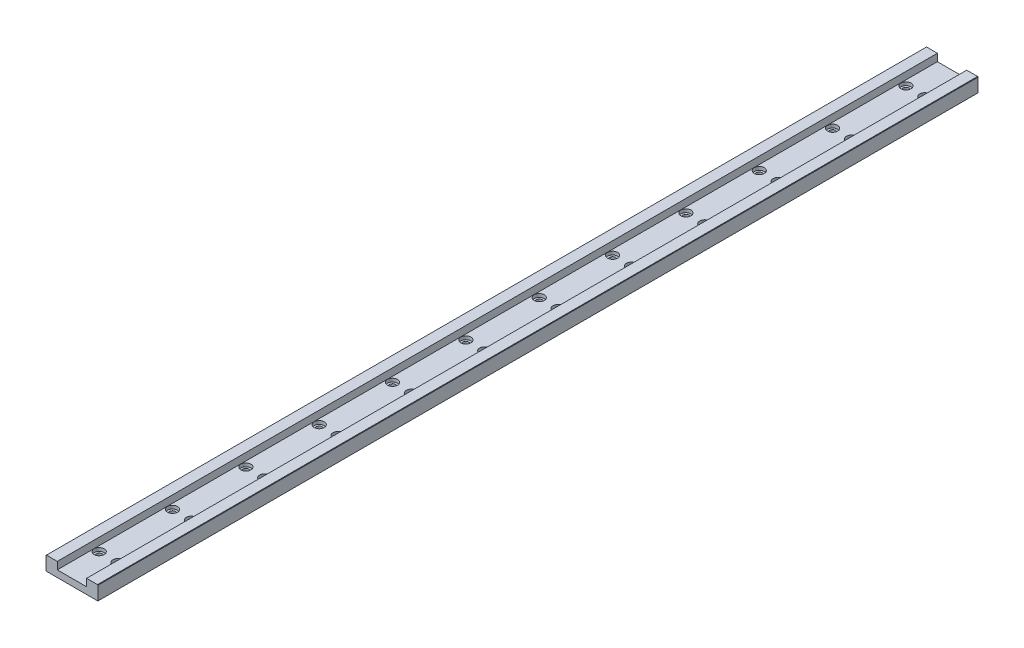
ISO-10303-21;
HEADER;
FILE_DESCRIPTION(('STEP AP214'),'2;1');
FILE_NAME('part.step','',(''),(''),'','','');
FILE_SCHEMA(('AUTOMOTIVE_DESIGN { 1 0 10303 214 1 1 1 1 }'));
ENDSEC;
DATA;
#1=APPLICATION_CONTEXT('core data for automotive mechanical design processes');
#2=APPLICATION_PROTOCOL_DEFINITION('international standard','automotive_design',2000,#1);
#3=PRODUCT_CONTEXT('',#1,'mechanical');
#4=PRODUCT('Part','Part','',(#3));
#5=PRODUCT_RELATED_PRODUCT_CATEGORY('part','',(#4));
#6=PRODUCT_DEFINITION_FORMATION('','',#4);
#7=PRODUCT_DEFINITION_CONTEXT('part definition',#1,'design');
#8=PRODUCT_DEFINITION('design','',#6,#7);
#9=PRODUCT_DEFINITION_SHAPE('','',#8);
#10=(LENGTH_UNIT() NAMED_UNIT(*) SI_UNIT(.MILLI.,.METRE.));
#11=(NAMED_UNIT(*) PLANE_ANGLE_UNIT() SI_UNIT($,.RADIAN.));
#12=(NAMED_UNIT(*) SI_UNIT($,.STERADIAN.) SOLID_ANGLE_UNIT());
#13=UNCERTAINTY_MEASURE_WITH_UNIT(LENGTH_MEASURE(1.E-05),#10,'distance_accuracy_value','');
#14=(GEOMETRIC_REPRESENTATION_CONTEXT(3) GLOBAL_UNCERTAINTY_ASSIGNED_CONTEXT((#13)) GLOBAL_UNIT_ASSIGNED_CONTEXT((#10,
#11,#12)) REPRESENTATION_CONTEXT('',''));
#15=CARTESIAN_POINT('',(0.,0.,0.));
#16=DIRECTION('',(0.,0.,1.));
#17=DIRECTION('',(1.,0.,0.));
#18=AXIS2_PLACEMENT_3D('',#15,#16,#17);
#19=CARTESIAN_POINT('',(-12.37869,6.7,210.));
#20=DIRECTION('',(1.,0.,0.));
#21=DIRECTION('',(0.,0.,-1.));
#22=AXIS2_PLACEMENT_3D('',#19,#20,#21);
#23=PLANE('',#22);
#24=DIRECTION('',(0.,-1.,0.));
#25=VECTOR('',#24,1.);
#26=CARTESIAN_POINT('',(-12.37869,6.7,210.));
#27=LINE('',#26,#25);
#28=CARTESIAN_POINT('',(-12.37869,6.5,210.));
#29=VERTEX_POINT('',#28);
#30=CARTESIAN_POINT('',(-12.37869,0.,210.));
#31=VERTEX_POINT('',#30);
#32=EDGE_CURVE('E157',#29,#31,#27,.T.);
#33=ORIENTED_EDGE('',*,*,#32,.F.);
#34=DIRECTION('',(0.,0.,-1.));
#35=VECTOR('',#34,1.);
#36=CARTESIAN_POINT('',(-12.37869,6.5,210.));
#37=LINE('',#36,#35);
#38=CARTESIAN_POINT('',(-12.37869,6.5,-210.));
#39=VERTEX_POINT('',#38);
#40=EDGE_CURVE('E47',#29,#39,#37,.T.);
#41=ORIENTED_EDGE('',*,*,#40,.T.);
#42=DIRECTION('',(0.,-1.,0.));
#43=VECTOR('',#42,1.);
#44=CARTESIAN_POINT('',(-12.37869,6.7,-210.));
#45=LINE('',#44,#43);
#46=CARTESIAN_POINT('',(-12.37869,0.,-210.));
#47=VERTEX_POINT('',#46);
#48=EDGE_CURVE('E117',#39,#47,#45,.T.);
#49=ORIENTED_EDGE('',*,*,#48,.T.);
#50=DIRECTION('',(0.,0.,-1.));
#51=VECTOR('',#50,1.);
#52=CARTESIAN_POINT('',(-12.37869,0.,210.));
#53=LINE('',#52,#51);
#54=EDGE_CURVE('E119',#31,#47,#53,.T.);
#55=ORIENTED_EDGE('',*,*,#54,.F.);
#56=EDGE_LOOP('',(#33,#41,#49,#55));
#57=FACE_BOUND('',#56,.T.);
#58=ADVANCED_FACE('F40',(#57),#23,.F.);
#59=CARTESIAN_POINT('',(-12.37869,0.,210.));
#60=DIRECTION('',(0.,1.,0.));
#61=DIRECTION('',(0.,0.,1.));
#62=AXIS2_PLACEMENT_3D('',#59,#60,#61);
#63=PLANE('',#62);
#64=CARTESIAN_POINT('',(4.5,0.,192.5));
#65=DIRECTION('',(0.,1.,0.));
#66=DIRECTION('',(0.,0.,1.));
#67=AXIS2_PLACEMENT_3D('',#64,#65,#66);
#68=CIRCLE('',#67,1.45);
#69=CARTESIAN_POINT('',(4.5,0.,193.95));
#70=VERTEX_POINT('',#69);
#71=EDGE_CURVE('E1317',#70,#70,#68,.T.);
#72=ORIENTED_EDGE('',*,*,#71,.T.);
#73=EDGE_LOOP('',(#72));
#74=FACE_BOUND('',#73,.T.);
#75=CARTESIAN_POINT('',(4.5,0.,157.5));
#76=DIRECTION('',(0.,1.,0.));
#77=DIRECTION('',(0.,0.,1.));
#78=AXIS2_PLACEMENT_3D('',#75,#76,#77);
#79=CIRCLE('',#78,1.45);
#80=CARTESIAN_POINT('',(4.5,0.,158.95));
#81=VERTEX_POINT('',#80);
#82=EDGE_CURVE('E1305',#81,#81,#79,.T.);
#83=ORIENTED_EDGE('',*,*,#82,.T.);
#84=EDGE_LOOP('',(#83));
#85=FACE_BOUND('',#84,.T.);
#86=CARTESIAN_POINT('',(4.5,0.,122.5));
#87=DIRECTION('',(0.,1.,0.));
#88=DIRECTION('',(0.,0.,1.));
#89=AXIS2_PLACEMENT_3D('',#86,#87,#88);
#90=CIRCLE('',#89,1.45);
#91=CARTESIAN_POINT('',(4.5,0.,123.95));
#92=VERTEX_POINT('',#91);
#93=EDGE_CURVE('E1293',#92,#92,#90,.T.);
#94=ORIENTED_EDGE('',*,*,#93,.T.);
#95=EDGE_LOOP('',(#94));
#96=FACE_BOUND('',#95,.T.);
#97=CARTESIAN_POINT('',(4.5,0.,87.5));
#98=DIRECTION('',(0.,1.,0.));
#99=DIRECTION('',(0.,0.,1.));
#100=AXIS2_PLACEMENT_3D('',#97,#98,#99);
#101=CIRCLE('',#100,1.45);
#102=CARTESIAN_POINT('',(4.5,0.,88.95));
#103=VERTEX_POINT('',#102);
#104=EDGE_CURVE('E1281',#103,#103,#101,.T.);
#105=ORIENTED_EDGE('',*,*,#104,.T.);
#106=EDGE_LOOP('',(#105));
#107=FACE_BOUND('',#106,.T.);
#108=CARTESIAN_POINT('',(4.5,0.,52.5));
#109=DIRECTION('',(0.,1.,0.));
#110=DIRECTION('',(0.,0.,1.));
#111=AXIS2_PLACEMENT_3D('',#108,#109,#110);
#112=CIRCLE('',#111,1.45);
#113=CARTESIAN_POINT('',(4.5,0.,53.95));
#114=VERTEX_POINT('',#113);
#115=EDGE_CURVE('E1269',#114,#114,#112,.T.);
#116=ORIENTED_EDGE('',*,*,#115,.T.);
#117=EDGE_LOOP('',(#116));
#118=FACE_BOUND('',#117,.T.);
#119=CARTESIAN_POINT('',(4.5,0.,-192.5));
#120=DIRECTION('',(0.,1.,0.));
#121=DIRECTION('',(0.,0.,1.));
#122=AXIS2_PLACEMENT_3D('',#119,#120,#121);
#123=CIRCLE('',#122,1.45);
#124=CARTESIAN_POINT('',(4.5,0.,-191.05));
#125=VERTEX_POINT('',#124);
#126=EDGE_CURVE('E1257',#125,#125,#123,.T.);
#127=ORIENTED_EDGE('',*,*,#126,.T.);
#128=EDGE_LOOP('',(#127));
#129=FACE_BOUND('',#128,.T.);
#130=CARTESIAN_POINT('',(4.5,0.,-157.5));
#131=DIRECTION('',(0.,1.,0.));
#132=DIRECTION('',(0.,0.,1.));
#133=AXIS2_PLACEMENT_3D('',#130,#131,#132);
#134=CIRCLE('',#133,1.45);
#135=CARTESIAN_POINT('',(4.5,0.,-156.05));
#136=VERTEX_POINT('',#135);
#137=EDGE_CURVE('E1245',#136,#136,#134,.T.);
#138=ORIENTED_EDGE('',*,*,#137,.T.);
#139=EDGE_LOOP('',(#138));
#140=FACE_BOUND('',#139,.T.);
#141=CARTESIAN_POINT('',(4.5,0.,-122.5));
#142=DIRECTION('',(0.,1.,0.));
#143=DIRECTION('',(0.,0.,1.));
#144=AXIS2_PLACEMENT_3D('',#141,#142,#143);
#145=CIRCLE('',#144,1.45);
#146=CARTESIAN_POINT('',(4.5,0.,-121.05));
#147=VERTEX_POINT('',#146);
#148=EDGE_CURVE('E1233',#147,#147,#145,.T.);
#149=ORIENTED_EDGE('',*,*,#148,.T.);
#150=EDGE_LOOP('',(#149));
#151=FACE_BOUND('',#150,.T.);
#152=CARTESIAN_POINT('',(4.5,0.,-87.5));
#153=DIRECTION('',(0.,1.,0.));
#154=DIRECTION('',(0.,0.,1.));
#155=AXIS2_PLACEMENT_3D('',#152,#153,#154);
#156=CIRCLE('',#155,1.45);
#157=CARTESIAN_POINT('',(4.5,0.,-86.05));
#158=VERTEX_POINT('',#157);
#159=EDGE_CURVE('E1221',#158,#158,#156,.T.);
#160=ORIENTED_EDGE('',*,*,#159,.T.);
#161=EDGE_LOOP('',(#160));
#162=FACE_BOUND('',#161,.T.);
#163=CARTESIAN_POINT('',(4.5,0.,-52.5));
#164=DIRECTION('',(0.,1.,0.));
#165=DIRECTION('',(0.,0.,1.));
#166=AXIS2_PLACEMENT_3D('',#163,#164,#165);
#167=CIRCLE('',#166,1.45);
#168=CARTESIAN_POINT('',(4.5,0.,-51.05));
#169=VERTEX_POINT('',#168);
#170=EDGE_CURVE('E1209',#169,#169,#167,.T.);
#171=ORIENTED_EDGE('',*,*,#170,.T.);
#172=EDGE_LOOP('',(#171));
#173=FACE_BOUND('',#172,.T.);
#174=CARTESIAN_POINT('',(4.5,0.,-17.5));
#175=DIRECTION('',(0.,1.,0.));
#176=DIRECTION('',(0.,0.,1.));
#177=AXIS2_PLACEMENT_3D('',#174,#175,#176);
#178=CIRCLE('',#177,1.45);
#179=CARTESIAN_POINT('',(4.5,0.,-16.05));
#180=VERTEX_POINT('',#179);
#181=EDGE_CURVE('E1197',#180,#180,#178,.T.);
#182=ORIENTED_EDGE('',*,*,#181,.T.);
#183=EDGE_LOOP('',(#182));
#184=FACE_BOUND('',#183,.T.);
#185=CARTESIAN_POINT('',(4.5,0.,17.5));
#186=DIRECTION('',(0.,1.,0.));
#187=DIRECTION('',(0.,0.,1.));
#188=AXIS2_PLACEMENT_3D('',#185,#186,#187);
#189=CIRCLE('',#188,1.45);
#190=CARTESIAN_POINT('',(4.5,0.,18.95));
#191=VERTEX_POINT('',#190);
#192=EDGE_CURVE('E1185',#191,#191,#189,.T.);
#193=ORIENTED_EDGE('',*,*,#192,.T.);
#194=EDGE_LOOP('',(#193));
#195=FACE_BOUND('',#194,.T.);
#196=CARTESIAN_POINT('',(-4.5,0.,192.5));
#197=DIRECTION('',(0.,1.,0.));
#198=DIRECTION('',(0.,0.,1.));
#199=AXIS2_PLACEMENT_3D('',#196,#197,#198);
#200=CIRCLE('',#199,1.45);
#201=CARTESIAN_POINT('',(-4.5,0.,193.95));
#202=VERTEX_POINT('',#201);
#203=EDGE_CURVE('E1173',#202,#202,#200,.T.);
#204=ORIENTED_EDGE('',*,*,#203,.T.);
#205=EDGE_LOOP('',(#204));
#206=FACE_BOUND('',#205,.T.);
#207=CARTESIAN_POINT('',(-4.5,0.,157.5));
#208=DIRECTION('',(0.,1.,0.));
#209=DIRECTION('',(0.,0.,1.));
#210=AXIS2_PLACEMENT_3D('',#207,#208,#209);
#211=CIRCLE('',#210,1.45);
#212=CARTESIAN_POINT('',(-4.5,0.,158.95));
#213=VERTEX_POINT('',#212);
#214=EDGE_CURVE('E1161',#213,#213,#211,.T.);
#215=ORIENTED_EDGE('',*,*,#214,.T.);
#216=EDGE_LOOP('',(#215));
#217=FACE_BOUND('',#216,.T.);
#218=CARTESIAN_POINT('',(-4.5,0.,122.5));
#219=DIRECTION('',(0.,1.,0.));
#220=DIRECTION('',(0.,0.,1.));
#221=AXIS2_PLACEMENT_3D('',#218,#219,#220);
#222=CIRCLE('',#221,1.45);
#223=CARTESIAN_POINT('',(-4.5,0.,123.95));
#224=VERTEX_POINT('',#223);
#225=EDGE_CURVE('E1149',#224,#224,#222,.T.);
#226=ORIENTED_EDGE('',*,*,#225,.T.);
#227=EDGE_LOOP('',(#226));
#228=FACE_BOUND('',#227,.T.);
#229=CARTESIAN_POINT('',(-4.5,0.,87.5));
#230=DIRECTION('',(0.,1.,0.));
#231=DIRECTION('',(0.,0.,1.));
#232=AXIS2_PLACEMENT_3D('',#229,#230,#231);
#233=CIRCLE('',#232,1.45);
#234=CARTESIAN_POINT('',(-4.5,0.,88.95));
#235=VERTEX_POINT('',#234);
#236=EDGE_CURVE('E1137',#235,#235,#233,.T.);
#237=ORIENTED_EDGE('',*,*,#236,.T.);
#238=EDGE_LOOP('',(#237));
#239=FACE_BOUND('',#238,.T.);
#240=CARTESIAN_POINT('',(-4.5,0.,52.5));
#241=DIRECTION('',(0.,1.,0.));
#242=DIRECTION('',(0.,0.,1.));
#243=AXIS2_PLACEMENT_3D('',#240,#241,#242);
#244=CIRCLE('',#243,1.45);
#245=CARTESIAN_POINT('',(-4.5,0.,53.95));
#246=VERTEX_POINT('',#245);
#247=EDGE_CURVE('E1125',#246,#246,#244,.T.);
#248=ORIENTED_EDGE('',*,*,#247,.T.);
#249=EDGE_LOOP('',(#248));
#250=FACE_BOUND('',#249,.T.);
#251=CARTESIAN_POINT('',(-4.5,0.,-192.5));
#252=DIRECTION('',(0.,1.,0.));
#253=DIRECTION('',(0.,0.,1.));
#254=AXIS2_PLACEMENT_3D('',#251,#252,#253);
#255=CIRCLE('',#254,1.45);
#256=CARTESIAN_POINT('',(-4.5,0.,-191.05));
#257=VERTEX_POINT('',#256);
#258=EDGE_CURVE('E1113',#257,#257,#255,.T.);
#259=ORIENTED_EDGE('',*,*,#258,.T.);
#260=EDGE_LOOP('',(#259));
#261=FACE_BOUND('',#260,.T.);
#262=CARTESIAN_POINT('',(-4.5,0.,-157.5));
#263=DIRECTION('',(0.,1.,0.));
#264=DIRECTION('',(0.,0.,1.));
#265=AXIS2_PLACEMENT_3D('',#262,#263,#264);
#266=CIRCLE('',#265,1.45);
#267=CARTESIAN_POINT('',(-4.5,0.,-156.05));
#268=VERTEX_POINT('',#267);
#269=EDGE_CURVE('E1101',#268,#268,#266,.T.);
#270=ORIENTED_EDGE('',*,*,#269,.T.);
#271=EDGE_LOOP('',(#270));
#272=FACE_BOUND('',#271,.T.);
#273=CARTESIAN_POINT('',(-4.5,0.,-122.5));
#274=DIRECTION('',(0.,1.,0.));
#275=DIRECTION('',(0.,0.,1.));
#276=AXIS2_PLACEMENT_3D('',#273,#274,#275);
#277=CIRCLE('',#276,1.45);
#278=CARTESIAN_POINT('',(-4.5,0.,-121.05));
#279=VERTEX_POINT('',#278);
#280=EDGE_CURVE('E1089',#279,#279,#277,.T.);
#281=ORIENTED_EDGE('',*,*,#280,.T.);
#282=EDGE_LOOP('',(#281));
#283=FACE_BOUND('',#282,.T.);
#284=CARTESIAN_POINT('',(-4.5,0.,-87.5));
#285=DIRECTION('',(0.,1.,0.));
#286=DIRECTION('',(0.,0.,1.));
#287=AXIS2_PLACEMENT_3D('',#284,#285,#286);
#288=CIRCLE('',#287,1.45);
#289=CARTESIAN_POINT('',(-4.5,0.,-86.05));
#290=VERTEX_POINT('',#289);
#291=EDGE_CURVE('E1077',#290,#290,#288,.T.);
#292=ORIENTED_EDGE('',*,*,#291,.T.);
#293=EDGE_LOOP('',(#292));
#294=FACE_BOUND('',#293,.T.);
#295=CARTESIAN_POINT('',(-4.5,0.,-52.5));
#296=DIRECTION('',(0.,1.,0.));
#297=DIRECTION('',(0.,0.,1.));
#298=AXIS2_PLACEMENT_3D('',#295,#296,#297);
#299=CIRCLE('',#298,1.45);
#300=CARTESIAN_POINT('',(-4.5,0.,-51.05));
#301=VERTEX_POINT('',#300);
#302=EDGE_CURVE('E1065',#301,#301,#299,.T.);
#303=ORIENTED_EDGE('',*,*,#302,.T.);
#304=EDGE_LOOP('',(#303));
#305=FACE_BOUND('',#304,.T.);
#306=CARTESIAN_POINT('',(-4.5,0.,-17.5));
#307=DIRECTION('',(0.,1.,0.));
#308=DIRECTION('',(0.,0.,1.));
#309=AXIS2_PLACEMENT_3D('',#306,#307,#308);
#310=CIRCLE('',#309,1.45);
#311=CARTESIAN_POINT('',(-4.5,0.,-16.05));
#312=VERTEX_POINT('',#311);
#313=EDGE_CURVE('E1053',#312,#312,#310,.T.);
#314=ORIENTED_EDGE('',*,*,#313,.T.);
#315=EDGE_LOOP('',(#314));
#316=FACE_BOUND('',#315,.T.);
#317=CARTESIAN_POINT('',(-4.5,0.,17.5));
#318=DIRECTION('',(0.,1.,0.));
#319=DIRECTION('',(0.,0.,1.));
#320=AXIS2_PLACEMENT_3D('',#317,#318,#319);
#321=CIRCLE('',#320,1.45);
#322=CARTESIAN_POINT('',(-4.5,0.,18.95));
#323=VERTEX_POINT('',#322);
#324=EDGE_CURVE('E124',#323,#323,#321,.T.);
#325=ORIENTED_EDGE('',*,*,#324,.T.);
#326=EDGE_LOOP('',(#325));
#327=FACE_BOUND('',#326,.T.);
#328=ORIENTED_EDGE('',*,*,#54,.T.);
#329=DIRECTION('',(1.,0.,0.));
#330=VECTOR('',#329,1.);
#331=CARTESIAN_POINT('',(-12.37869,0.,-210.));
#332=LINE('',#331,#330);
#333=CARTESIAN_POINT('',(12.37869,0.,-210.));
#334=VERTEX_POINT('',#333);
#335=EDGE_CURVE('E123',#47,#334,#332,.T.);
#336=ORIENTED_EDGE('',*,*,#335,.T.);
#337=DIRECTION('',(0.,0.,-1.));
#338=VECTOR('',#337,1.);
#339=CARTESIAN_POINT('',(12.37869,0.,210.));
#340=LINE('',#339,#338);
#341=CARTESIAN_POINT('',(12.37869,0.,210.));
#342=VERTEX_POINT('',#341);
#343=EDGE_CURVE('E133',#342,#334,#340,.T.);
#344=ORIENTED_EDGE('',*,*,#343,.F.);
#345=DIRECTION('',(1.,0.,0.));
#346=VECTOR('',#345,1.);
#347=CARTESIAN_POINT('',(-12.37869,0.,210.));
#348=LINE('',#347,#346);
#349=EDGE_CURVE('E131',#31,#342,#348,.T.);
#350=ORIENTED_EDGE('',*,*,#349,.F.);
#351=EDGE_LOOP('',(#328,#336,#344,#350));
#352=FACE_BOUND('',#351,.T.);
#353=ADVANCED_FACE('F129',(#74,#85,#96,#107,#118,#129,#140,#151,#162,#173,#184,#195,#206,#217,
#228,#239,#250,#261,#272,#283,#294,#305,#316,#327,#352),#63,.F.);
#354=CARTESIAN_POINT('',(12.37869,6.7,210.));
#355=DIRECTION('',(-1.,0.,0.));
#356=DIRECTION('',(0.,0.,1.));
#357=AXIS2_PLACEMENT_3D('',#354,#355,#356);
#358=PLANE('',#357);
#359=DIRECTION('',(0.,1.,0.));
#360=VECTOR('',#359,1.);
#361=CARTESIAN_POINT('',(12.37869,6.7,-210.));
#362=LINE('',#361,#360);
#363=CARTESIAN_POINT('',(12.37869,6.5,-210.));
#364=VERTEX_POINT('',#363);
#365=EDGE_CURVE('E139',#334,#364,#362,.T.);
#366=ORIENTED_EDGE('',*,*,#365,.T.);
#367=DIRECTION('',(0.,0.,1.));
#368=VECTOR('',#367,1.);
#369=CARTESIAN_POINT('',(12.37869,6.5,210.));
#370=LINE('',#369,#368);
#371=CARTESIAN_POINT('',(12.37869,6.49999999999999,210.));
#372=VERTEX_POINT('',#371);
#373=EDGE_CURVE('E189',#364,#372,#370,.T.);
#374=ORIENTED_EDGE('',*,*,#373,.T.);
#375=DIRECTION('',(0.,1.,0.));
#376=VECTOR('',#375,1.);
#377=CARTESIAN_POINT('',(12.37869,6.7,210.));
#378=LINE('',#377,#376);
#379=EDGE_CURVE('E160',#342,#372,#378,.T.);
#380=ORIENTED_EDGE('',*,*,#379,.F.);
#381=ORIENTED_EDGE('',*,*,#343,.T.);
#382=EDGE_LOOP('',(#366,#374,#380,#381));
#383=FACE_BOUND('',#382,.T.);
#384=ADVANCED_FACE('F207',(#383),#358,.F.);
#385=CARTESIAN_POINT('',(7.,6.7,210.));
#386=DIRECTION('',(0.,-1.,0.));
#387=DIRECTION('',(0.,0.,-1.));
#388=AXIS2_PLACEMENT_3D('',#385,#386,#387);
#389=PLANE('',#388);
#390=DIRECTION('',(-1.,0.,0.));
#391=VECTOR('',#390,1.);
#392=CARTESIAN_POINT('',(7.,6.7,210.));
#393=LINE('',#392,#391);
#394=CARTESIAN_POINT('',(12.17869,6.7,210.));
#395=VERTEX_POINT('',#394);
#396=CARTESIAN_POINT('',(7.,6.7,210.));
#397=VERTEX_POINT('',#396);
#398=EDGE_CURVE('E163',#395,#397,#393,.T.);
#399=ORIENTED_EDGE('',*,*,#398,.F.);
#400=DIRECTION('',(0.,0.,-1.));
#401=VECTOR('',#400,1.);
#402=CARTESIAN_POINT('',(12.17869,6.7,210.));
#403=LINE('',#402,#401);
#404=CARTESIAN_POINT('',(12.17869,6.7,-210.));
#405=VERTEX_POINT('',#404);
#406=EDGE_CURVE('E132',#395,#405,#403,.T.);
#407=ORIENTED_EDGE('',*,*,#406,.T.);
#408=DIRECTION('',(-1.,0.,0.));
#409=VECTOR('',#408,1.);
#410=CARTESIAN_POINT('',(7.,6.7,-210.));
#411=LINE('',#410,#409);
#412=CARTESIAN_POINT('',(7.,6.7,-210.));
#413=VERTEX_POINT('',#412);
#414=EDGE_CURVE('E141',#405,#413,#411,.T.);
#415=ORIENTED_EDGE('',*,*,#414,.T.);
#416=DIRECTION('',(0.,0.,-1.));
#417=VECTOR('',#416,1.);
#418=CARTESIAN_POINT('',(7.,6.7,210.));
#419=LINE('',#418,#417);
#420=EDGE_CURVE('E179',#397,#413,#419,.T.);
#421=ORIENTED_EDGE('',*,*,#420,.F.);
#422=EDGE_LOOP('',(#399,#407,#415,#421));
#423=FACE_BOUND('',#422,.T.);
#424=ADVANCED_FACE('F202',(#423),#389,.F.);
#425=CARTESIAN_POINT('',(7.,3.2,210.));
#426=DIRECTION('',(1.,0.,0.));
#427=DIRECTION('',(0.,0.,-1.));
#428=AXIS2_PLACEMENT_3D('',#425,#426,#427);
#429=PLANE('',#428);
#430=ORIENTED_EDGE('',*,*,#420,.T.);
#431=DIRECTION('',(0.,-1.,0.));
#432=VECTOR('',#431,1.);
#433=CARTESIAN_POINT('',(7.,3.2,-210.));
#434=LINE('',#433,#432);
#435=CARTESIAN_POINT('',(7.,3.2,-210.));
#436=VERTEX_POINT('',#435);
#437=EDGE_CURVE('E146',#413,#436,#434,.T.);
#438=ORIENTED_EDGE('',*,*,#437,.T.);
#439=DIRECTION('',(0.,0.,-1.));
#440=VECTOR('',#439,1.);
#441=CARTESIAN_POINT('',(7.,3.2,210.));
#442=LINE('',#441,#440);
#443=CARTESIAN_POINT('',(7.,3.2,210.));
#444=VERTEX_POINT('',#443);
#445=EDGE_CURVE('E177',#444,#436,#442,.T.);
#446=ORIENTED_EDGE('',*,*,#445,.F.);
#447=DIRECTION('',(0.,-1.,0.));
#448=VECTOR('',#447,1.);
#449=CARTESIAN_POINT('',(7.,3.2,210.));
#450=LINE('',#449,#448);
#451=EDGE_CURVE('E165',#397,#444,#450,.T.);
#452=ORIENTED_EDGE('',*,*,#451,.F.);
#453=EDGE_LOOP('',(#430,#438,#446,#452));
#454=FACE_BOUND('',#453,.T.);
#455=ADVANCED_FACE('F214',(#454),#429,.F.);
#456=CARTESIAN_POINT('',(-7.,3.2,210.));
#457=DIRECTION('',(0.,-1.,0.));
#458=DIRECTION('',(0.,0.,-1.));
#459=AXIS2_PLACEMENT_3D('',#456,#457,#458);
#460=PLANE('',#459);
#461=CARTESIAN_POINT('',(4.5,3.2,192.5));
#462=DIRECTION('',(0.,1.,0.));
#463=DIRECTION('',(0.,0.,1.));
#464=AXIS2_PLACEMENT_3D('',#461,#462,#463);
#465=CIRCLE('',#464,2.4);
#466=CARTESIAN_POINT('',(4.5,3.2,194.9));
#467=VERTEX_POINT('',#466);
#468=EDGE_CURVE('E1326',#467,#467,#465,.T.);
#469=ORIENTED_EDGE('',*,*,#468,.F.);
#470=EDGE_LOOP('',(#469));
#471=FACE_BOUND('',#470,.T.);
#472=CARTESIAN_POINT('',(4.5,3.2,157.5));
#473=DIRECTION('',(0.,1.,0.));
#474=DIRECTION('',(0.,0.,1.));
#475=AXIS2_PLACEMENT_3D('',#472,#473,#474);
#476=CIRCLE('',#475,2.4);
#477=CARTESIAN_POINT('',(4.5,3.2,159.9));
#478=VERTEX_POINT('',#477);
#479=EDGE_CURVE('E1314',#478,#478,#476,.T.);
#480=ORIENTED_EDGE('',*,*,#479,.F.);
#481=EDGE_LOOP('',(#480));
#482=FACE_BOUND('',#481,.T.);
#483=CARTESIAN_POINT('',(4.5,3.2,122.5));
#484=DIRECTION('',(0.,1.,0.));
#485=DIRECTION('',(0.,0.,1.));
#486=AXIS2_PLACEMENT_3D('',#483,#484,#485);
#487=CIRCLE('',#486,2.4);
#488=CARTESIAN_POINT('',(4.5,3.2,124.9));
#489=VERTEX_POINT('',#488);
#490=EDGE_CURVE('E1302',#489,#489,#487,.T.);
#491=ORIENTED_EDGE('',*,*,#490,.F.);
#492=EDGE_LOOP('',(#491));
#493=FACE_BOUND('',#492,.T.);
#494=CARTESIAN_POINT('',(4.5,3.2,87.5));
#495=DIRECTION('',(0.,1.,0.));
#496=DIRECTION('',(0.,0.,1.));
#497=AXIS2_PLACEMENT_3D('',#494,#495,#496);
#498=CIRCLE('',#497,2.4);
#499=CARTESIAN_POINT('',(4.5,3.2,89.9));
#500=VERTEX_POINT('',#499);
#501=EDGE_CURVE('E1290',#500,#500,#498,.T.);
#502=ORIENTED_EDGE('',*,*,#501,.F.);
#503=EDGE_LOOP('',(#502));
#504=FACE_BOUND('',#503,.T.);
#505=CARTESIAN_POINT('',(4.5,3.2,52.5));
#506=DIRECTION('',(0.,1.,0.));
#507=DIRECTION('',(0.,0.,1.));
#508=AXIS2_PLACEMENT_3D('',#505,#506,#507);
#509=CIRCLE('',#508,2.4);
#510=CARTESIAN_POINT('',(4.5,3.2,54.9));
#511=VERTEX_POINT('',#510);
#512=EDGE_CURVE('E1278',#511,#511,#509,.T.);
#513=ORIENTED_EDGE('',*,*,#512,.F.);
#514=EDGE_LOOP('',(#513));
#515=FACE_BOUND('',#514,.T.);
#516=CARTESIAN_POINT('',(4.5,3.2,-192.5));
#517=DIRECTION('',(0.,1.,0.));
#518=DIRECTION('',(0.,0.,1.));
#519=AXIS2_PLACEMENT_3D('',#516,#517,#518);
#520=CIRCLE('',#519,2.4);
#521=CARTESIAN_POINT('',(4.5,3.2,-190.1));
#522=VERTEX_POINT('',#521);
#523=EDGE_CURVE('E1266',#522,#522,#520,.T.);
#524=ORIENTED_EDGE('',*,*,#523,.F.);
#525=EDGE_LOOP('',(#524));
#526=FACE_BOUND('',#525,.T.);
#527=CARTESIAN_POINT('',(4.5,3.2,-157.5));
#528=DIRECTION('',(0.,1.,0.));
#529=DIRECTION('',(0.,0.,1.));
#530=AXIS2_PLACEMENT_3D('',#527,#528,#529);
#531=CIRCLE('',#530,2.4);
#532=CARTESIAN_POINT('',(4.5,3.2,-155.1));
#533=VERTEX_POINT('',#532);
#534=EDGE_CURVE('E1254',#533,#533,#531,.T.);
#535=ORIENTED_EDGE('',*,*,#534,.F.);
#536=EDGE_LOOP('',(#535));
#537=FACE_BOUND('',#536,.T.);
#538=CARTESIAN_POINT('',(4.5,3.2,-122.5));
#539=DIRECTION('',(0.,1.,0.));
#540=DIRECTION('',(0.,0.,1.));
#541=AXIS2_PLACEMENT_3D('',#538,#539,#540);
#542=CIRCLE('',#541,2.4);
#543=CARTESIAN_POINT('',(4.5,3.2,-120.1));
#544=VERTEX_POINT('',#543);
#545=EDGE_CURVE('E1242',#544,#544,#542,.T.);
#546=ORIENTED_EDGE('',*,*,#545,.F.);
#547=EDGE_LOOP('',(#546));
#548=FACE_BOUND('',#547,.T.);
#549=CARTESIAN_POINT('',(4.5,3.2,-87.5));
#550=DIRECTION('',(0.,1.,0.));
#551=DIRECTION('',(0.,0.,1.));
#552=AXIS2_PLACEMENT_3D('',#549,#550,#551);
#553=CIRCLE('',#552,2.4);
#554=CARTESIAN_POINT('',(4.5,3.2,-85.1));
#555=VERTEX_POINT('',#554);
#556=EDGE_CURVE('E1230',#555,#555,#553,.T.);
#557=ORIENTED_EDGE('',*,*,#556,.F.);
#558=EDGE_LOOP('',(#557));
#559=FACE_BOUND('',#558,.T.);
#560=CARTESIAN_POINT('',(4.5,3.2,-52.5));
#561=DIRECTION('',(0.,1.,0.));
#562=DIRECTION('',(0.,0.,1.));
#563=AXIS2_PLACEMENT_3D('',#560,#561,#562);
#564=CIRCLE('',#563,2.4);
#565=CARTESIAN_POINT('',(4.5,3.2,-50.1));
#566=VERTEX_POINT('',#565);
#567=EDGE_CURVE('E1218',#566,#566,#564,.T.);
#568=ORIENTED_EDGE('',*,*,#567,.F.);
#569=EDGE_LOOP('',(#568));
#570=FACE_BOUND('',#569,.T.);
#571=CARTESIAN_POINT('',(4.5,3.2,-17.5));
#572=DIRECTION('',(0.,1.,0.));
#573=DIRECTION('',(0.,0.,1.));
#574=AXIS2_PLACEMENT_3D('',#571,#572,#573);
#575=CIRCLE('',#574,2.4);
#576=CARTESIAN_POINT('',(4.5,3.2,-15.1));
#577=VERTEX_POINT('',#576);
#578=EDGE_CURVE('E1206',#577,#577,#575,.T.);
#579=ORIENTED_EDGE('',*,*,#578,.F.);
#580=EDGE_LOOP('',(#579));
#581=FACE_BOUND('',#580,.T.);
#582=CARTESIAN_POINT('',(4.5,3.2,17.5));
#583=DIRECTION('',(0.,1.,0.));
#584=DIRECTION('',(0.,0.,1.));
#585=AXIS2_PLACEMENT_3D('',#582,#583,#584);
#586=CIRCLE('',#585,2.4);
#587=CARTESIAN_POINT('',(4.5,3.2,19.9));
#588=VERTEX_POINT('',#587);
#589=EDGE_CURVE('E1194',#588,#588,#586,.T.);
#590=ORIENTED_EDGE('',*,*,#589,.F.);
#591=EDGE_LOOP('',(#590));
#592=FACE_BOUND('',#591,.T.);
#593=CARTESIAN_POINT('',(-4.5,3.2,192.5));
#594=DIRECTION('',(0.,1.,0.));
#595=DIRECTION('',(0.,0.,1.));
#596=AXIS2_PLACEMENT_3D('',#593,#594,#595);
#597=CIRCLE('',#596,2.4);
#598=CARTESIAN_POINT('',(-4.5,3.2,194.9));
#599=VERTEX_POINT('',#598);
#600=EDGE_CURVE('E1182',#599,#599,#597,.T.);
#601=ORIENTED_EDGE('',*,*,#600,.F.);
#602=EDGE_LOOP('',(#601));
#603=FACE_BOUND('',#602,.T.);
#604=CARTESIAN_POINT('',(-4.5,3.2,157.5));
#605=DIRECTION('',(0.,1.,0.));
#606=DIRECTION('',(0.,0.,1.));
#607=AXIS2_PLACEMENT_3D('',#604,#605,#606);
#608=CIRCLE('',#607,2.4);
#609=CARTESIAN_POINT('',(-4.5,3.2,159.9));
#610=VERTEX_POINT('',#609);
#611=EDGE_CURVE('E1170',#610,#610,#608,.T.);
#612=ORIENTED_EDGE('',*,*,#611,.F.);
#613=EDGE_LOOP('',(#612));
#614=FACE_BOUND('',#613,.T.);
#615=CARTESIAN_POINT('',(-4.5,3.2,122.5));
#616=DIRECTION('',(0.,1.,0.));
#617=DIRECTION('',(0.,0.,1.));
#618=AXIS2_PLACEMENT_3D('',#615,#616,#617);
#619=CIRCLE('',#618,2.4);
#620=CARTESIAN_POINT('',(-4.5,3.2,124.9));
#621=VERTEX_POINT('',#620);
#622=EDGE_CURVE('E1158',#621,#621,#619,.T.);
#623=ORIENTED_EDGE('',*,*,#622,.F.);
#624=EDGE_LOOP('',(#623));
#625=FACE_BOUND('',#624,.T.);
#626=CARTESIAN_POINT('',(-4.5,3.2,87.5));
#627=DIRECTION('',(0.,1.,0.));
#628=DIRECTION('',(0.,0.,1.));
#629=AXIS2_PLACEMENT_3D('',#626,#627,#628);
#630=CIRCLE('',#629,2.4);
#631=CARTESIAN_POINT('',(-4.5,3.2,89.9));
#632=VERTEX_POINT('',#631);
#633=EDGE_CURVE('E1146',#632,#632,#630,.T.);
#634=ORIENTED_EDGE('',*,*,#633,.F.);
#635=EDGE_LOOP('',(#634));
#636=FACE_BOUND('',#635,.T.);
#637=CARTESIAN_POINT('',(-4.5,3.2,52.5));
#638=DIRECTION('',(0.,1.,0.));
#639=DIRECTION('',(0.,0.,1.));
#640=AXIS2_PLACEMENT_3D('',#637,#638,#639);
#641=CIRCLE('',#640,2.4);
#642=CARTESIAN_POINT('',(-4.5,3.2,54.9));
#643=VERTEX_POINT('',#642);
#644=EDGE_CURVE('E1134',#643,#643,#641,.T.);
#645=ORIENTED_EDGE('',*,*,#644,.F.);
#646=EDGE_LOOP('',(#645));
#647=FACE_BOUND('',#646,.T.);
#648=CARTESIAN_POINT('',(-4.5,3.2,-192.5));
#649=DIRECTION('',(0.,1.,0.));
#650=DIRECTION('',(0.,0.,1.));
#651=AXIS2_PLACEMENT_3D('',#648,#649,#650);
#652=CIRCLE('',#651,2.4);
#653=CARTESIAN_POINT('',(-4.5,3.2,-190.1));
#654=VERTEX_POINT('',#653);
#655=EDGE_CURVE('E1122',#654,#654,#652,.T.);
#656=ORIENTED_EDGE('',*,*,#655,.F.);
#657=EDGE_LOOP('',(#656));
#658=FACE_BOUND('',#657,.T.);
#659=CARTESIAN_POINT('',(-4.5,3.2,-157.5));
#660=DIRECTION('',(0.,1.,0.));
#661=DIRECTION('',(0.,0.,1.));
#662=AXIS2_PLACEMENT_3D('',#659,#660,#661);
#663=CIRCLE('',#662,2.4);
#664=CARTESIAN_POINT('',(-4.5,3.2,-155.1));
#665=VERTEX_POINT('',#664);
#666=EDGE_CURVE('E1110',#665,#665,#663,.T.);
#667=ORIENTED_EDGE('',*,*,#666,.F.);
#668=EDGE_LOOP('',(#667));
#669=FACE_BOUND('',#668,.T.);
#670=CARTESIAN_POINT('',(-4.5,3.2,-122.5));
#671=DIRECTION('',(0.,1.,0.));
#672=DIRECTION('',(0.,0.,1.));
#673=AXIS2_PLACEMENT_3D('',#670,#671,#672);
#674=CIRCLE('',#673,2.4);
#675=CARTESIAN_POINT('',(-4.5,3.2,-120.1));
#676=VERTEX_POINT('',#675);
#677=EDGE_CURVE('E1098',#676,#676,#674,.T.);
#678=ORIENTED_EDGE('',*,*,#677,.F.);
#679=EDGE_LOOP('',(#678));
#680=FACE_BOUND('',#679,.T.);
#681=CARTESIAN_POINT('',(-4.5,3.2,-87.5));
#682=DIRECTION('',(0.,1.,0.));
#683=DIRECTION('',(0.,0.,1.));
#684=AXIS2_PLACEMENT_3D('',#681,#682,#683);
#685=CIRCLE('',#684,2.4);
#686=CARTESIAN_POINT('',(-4.5,3.2,-85.1));
#687=VERTEX_POINT('',#686);
#688=EDGE_CURVE('E1086',#687,#687,#685,.T.);
#689=ORIENTED_EDGE('',*,*,#688,.F.);
#690=EDGE_LOOP('',(#689));
#691=FACE_BOUND('',#690,.T.);
#692=CARTESIAN_POINT('',(-4.5,3.2,-52.5));
#693=DIRECTION('',(0.,1.,0.));
#694=DIRECTION('',(0.,0.,1.));
#695=AXIS2_PLACEMENT_3D('',#692,#693,#694);
#696=CIRCLE('',#695,2.4);
#697=CARTESIAN_POINT('',(-4.5,3.2,-50.1));
#698=VERTEX_POINT('',#697);
#699=EDGE_CURVE('E1074',#698,#698,#696,.T.);
#700=ORIENTED_EDGE('',*,*,#699,.F.);
#701=EDGE_LOOP('',(#700));
#702=FACE_BOUND('',#701,.T.);
#703=CARTESIAN_POINT('',(-4.5,3.2,-17.5));
#704=DIRECTION('',(0.,1.,0.));
#705=DIRECTION('',(0.,0.,1.));
#706=AXIS2_PLACEMENT_3D('',#703,#704,#705);
#707=CIRCLE('',#706,2.4);
#708=CARTESIAN_POINT('',(-4.5,3.2,-15.1));
#709=VERTEX_POINT('',#708);
#710=EDGE_CURVE('E1062',#709,#709,#707,.T.);
#711=ORIENTED_EDGE('',*,*,#710,.F.);
#712=EDGE_LOOP('',(#711));
#713=FACE_BOUND('',#712,.T.);
#714=CARTESIAN_POINT('',(-4.5,3.2,17.5));
#715=DIRECTION('',(0.,1.,0.));
#716=DIRECTION('',(0.,0.,1.));
#717=AXIS2_PLACEMENT_3D('',#714,#715,#716);
#718=CIRCLE('',#717,2.4);
#719=CARTESIAN_POINT('',(-4.5,3.2,19.9));
#720=VERTEX_POINT('',#719);
#721=EDGE_CURVE('E1048',#720,#720,#718,.T.);
#722=ORIENTED_EDGE('',*,*,#721,.F.);
#723=EDGE_LOOP('',(#722));
#724=FACE_BOUND('',#723,.T.);
#725=ORIENTED_EDGE('',*,*,#445,.T.);
#726=DIRECTION('',(-1.,0.,0.));
#727=VECTOR('',#726,1.);
#728=CARTESIAN_POINT('',(-7.,3.2,-210.));
#729=LINE('',#728,#727);
#730=CARTESIAN_POINT('',(-7.,3.2,-210.));
#731=VERTEX_POINT('',#730);
#732=EDGE_CURVE('E149',#436,#731,#729,.T.);
#733=ORIENTED_EDGE('',*,*,#732,.T.);
#734=DIRECTION('',(0.,0.,-1.));
#735=VECTOR('',#734,1.);
#736=CARTESIAN_POINT('',(-7.,3.2,210.));
#737=LINE('',#736,#735);
#738=CARTESIAN_POINT('',(-7.,3.2,210.));
#739=VERTEX_POINT('',#738);
#740=EDGE_CURVE('E175',#739,#731,#737,.T.);
#741=ORIENTED_EDGE('',*,*,#740,.F.);
#742=DIRECTION('',(-1.,0.,0.));
#743=VECTOR('',#742,1.);
#744=CARTESIAN_POINT('',(-7.,3.2,210.));
#745=LINE('',#744,#743);
#746=EDGE_CURVE('E167',#444,#739,#745,.T.);
#747=ORIENTED_EDGE('',*,*,#746,.F.);
#748=EDGE_LOOP('',(#725,#733,#741,#747));
#749=FACE_BOUND('',#748,.T.);
#750=ADVANCED_FACE('F237',(#471,#482,#493,#504,#515,#526,#537,#548,#559,#570,#581,#592,#603,
#614,#625,#636,#647,#658,#669,#680,#691,#702,#713,#724,#749),#460,.F.);
#751=CARTESIAN_POINT('',(-7.,6.7,210.));
#752=DIRECTION('',(-1.,0.,0.));
#753=DIRECTION('',(0.,0.,1.));
#754=AXIS2_PLACEMENT_3D('',#751,#752,#753);
#755=PLANE('',#754);
#756=ORIENTED_EDGE('',*,*,#740,.T.);
#757=DIRECTION('',(0.,1.,0.));
#758=VECTOR('',#757,1.);
#759=CARTESIAN_POINT('',(-7.,6.7,-210.));
#760=LINE('',#759,#758);
#761=CARTESIAN_POINT('',(-7.,6.7,-210.));
#762=VERTEX_POINT('',#761);
#763=EDGE_CURVE('E152',#731,#762,#760,.T.);
#764=ORIENTED_EDGE('',*,*,#763,.T.);
#765=DIRECTION('',(0.,0.,-1.));
#766=VECTOR('',#765,1.);
#767=CARTESIAN_POINT('',(-7.,6.7,210.));
#768=LINE('',#767,#766);
#769=CARTESIAN_POINT('',(-7.,6.7,210.));
#770=VERTEX_POINT('',#769);
#771=EDGE_CURVE('E173',#770,#762,#768,.T.);
#772=ORIENTED_EDGE('',*,*,#771,.F.);
#773=DIRECTION('',(0.,1.,0.));
#774=VECTOR('',#773,1.);
#775=CARTESIAN_POINT('',(-7.,6.7,210.));
#776=LINE('',#775,#774);
#777=EDGE_CURVE('E169',#739,#770,#776,.T.);
#778=ORIENTED_EDGE('',*,*,#777,.F.);
#779=EDGE_LOOP('',(#756,#764,#772,#778));
#780=FACE_BOUND('',#779,.T.);
#781=ADVANCED_FACE('F242',(#780),#755,.F.);
#782=CARTESIAN_POINT('',(-12.37869,6.7,210.));
#783=DIRECTION('',(0.,-1.,0.));
#784=DIRECTION('',(0.,0.,-1.));
#785=AXIS2_PLACEMENT_3D('',#782,#783,#784);
#786=PLANE('',#785);
#787=DIRECTION('',(-1.,0.,0.));
#788=VECTOR('',#787,1.);
#789=CARTESIAN_POINT('',(-12.37869,6.7,-210.));
#790=LINE('',#789,#788);
#791=CARTESIAN_POINT('',(-12.17869,6.7,-210.));
#792=VERTEX_POINT('',#791);
#793=EDGE_CURVE('E155',#762,#792,#790,.T.);
#794=ORIENTED_EDGE('',*,*,#793,.T.);
#795=DIRECTION('',(0.,0.,1.));
#796=VECTOR('',#795,1.);
#797=CARTESIAN_POINT('',(-12.17869,6.7,210.));
#798=LINE('',#797,#796);
#799=CARTESIAN_POINT('',(-12.17869,6.7,210.));
#800=VERTEX_POINT('',#799);
#801=EDGE_CURVE('E12',#792,#800,#798,.T.);
#802=ORIENTED_EDGE('',*,*,#801,.T.);
#803=DIRECTION('',(-1.,0.,0.));
#804=VECTOR('',#803,1.);
#805=CARTESIAN_POINT('',(-12.37869,6.7,210.));
#806=LINE('',#805,#804);
#807=EDGE_CURVE('E171',#770,#800,#806,.T.);
#808=ORIENTED_EDGE('',*,*,#807,.F.);
#809=ORIENTED_EDGE('',*,*,#771,.T.);
#810=EDGE_LOOP('',(#794,#802,#808,#809));
#811=FACE_BOUND('',#810,.T.);
#812=ADVANCED_FACE('F776',(#811),#786,.F.);
#813=CARTESIAN_POINT('',(-12.37869,0.,210.));
#814=DIRECTION('',(0.,0.,1.));
#815=DIRECTION('',(1.,0.,0.));
#816=AXIS2_PLACEMENT_3D('',#813,#814,#815);
#817=PLANE('',#816);
#818=ORIENTED_EDGE('',*,*,#379,.T.);
#819=DIRECTION('',(0.707106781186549,-0.707106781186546,0.));
#820=VECTOR('',#819,1.);
#821=CARTESIAN_POINT('',(3.24999999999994,15.62869,210.));
#822=LINE('',#821,#820);
#823=EDGE_CURVE('E192',#372,#395,#822,.F.);
#824=ORIENTED_EDGE('',*,*,#823,.T.);
#825=ORIENTED_EDGE('',*,*,#398,.T.);
#826=ORIENTED_EDGE('',*,*,#451,.T.);
#827=ORIENTED_EDGE('',*,*,#746,.T.);
#828=ORIENTED_EDGE('',*,*,#777,.T.);
#829=ORIENTED_EDGE('',*,*,#807,.T.);
#830=DIRECTION('',(0.707106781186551,0.707106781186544,0.));
#831=VECTOR('',#830,1.);
#832=CARTESIAN_POINT('',(-15.62869,3.25000000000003,210.));
#833=LINE('',#832,#831);
#834=EDGE_CURVE('E59',#800,#29,#833,.F.);
#835=ORIENTED_EDGE('',*,*,#834,.T.);
#836=ORIENTED_EDGE('',*,*,#32,.T.);
#837=ORIENTED_EDGE('',*,*,#349,.T.);
#838=EDGE_LOOP('',(#818,#824,#825,#826,#827,#828,#829,#835,#836,#837));
#839=FACE_BOUND('',#838,.T.);
#840=ADVANCED_FACE('F195',(#839),#817,.T.);
#841=CARTESIAN_POINT('',(-12.37869,0.,-210.));
#842=DIRECTION('',(0.,0.,1.));
#843=DIRECTION('',(1.,0.,0.));
#844=AXIS2_PLACEMENT_3D('',#841,#842,#843);
#845=PLANE('',#844);
#846=ORIENTED_EDGE('',*,*,#414,.F.);
#847=DIRECTION('',(-0.707106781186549,0.707106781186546,0.));
#848=VECTOR('',#847,1.);
#849=CARTESIAN_POINT('',(12.17869,6.7,-210.));
#850=LINE('',#849,#848);
#851=EDGE_CURVE('E187',#405,#364,#850,.F.);
#852=ORIENTED_EDGE('',*,*,#851,.T.);
#853=ORIENTED_EDGE('',*,*,#365,.F.);
#854=ORIENTED_EDGE('',*,*,#335,.F.);
#855=ORIENTED_EDGE('',*,*,#48,.F.);
#856=DIRECTION('',(-0.707106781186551,-0.707106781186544,0.));
#857=VECTOR('',#856,1.);
#858=CARTESIAN_POINT('',(-12.37869,6.5,-210.));
#859=LINE('',#858,#857);
#860=EDGE_CURVE('E185',#39,#792,#859,.F.);
#861=ORIENTED_EDGE('',*,*,#860,.T.);
#862=ORIENTED_EDGE('',*,*,#793,.F.);
#863=ORIENTED_EDGE('',*,*,#763,.F.);
#864=ORIENTED_EDGE('',*,*,#732,.F.);
#865=ORIENTED_EDGE('',*,*,#437,.F.);
#866=EDGE_LOOP('',(#846,#852,#853,#854,#855,#861,#862,#863,#864,#865));
#867=FACE_BOUND('',#866,.T.);
#868=ADVANCED_FACE('F137',(#867),#845,.F.);
#869=CARTESIAN_POINT('',(-4.5,3.2,17.5));
#870=DIRECTION('',(0.,1.,0.));
#871=DIRECTION('',(0.,0.,1.));
#872=AXIS2_PLACEMENT_3D('',#869,#870,#871);
#873=CYLINDRICAL_SURFACE('',#872,1.45);
#874=ORIENTED_EDGE('',*,*,#324,.F.);
#875=EDGE_LOOP('',(#874));
#876=FACE_BOUND('',#875,.T.);
#877=CARTESIAN_POINT('',(-4.5,1.6,17.5));
#878=DIRECTION('',(0.,1.,0.));
#879=DIRECTION('',(0.,0.,1.));
#880=AXIS2_PLACEMENT_3D('',#877,#878,#879);
#881=CIRCLE('',#880,1.45);
#882=CARTESIAN_POINT('',(-4.5,1.6,18.95));
#883=VERTEX_POINT('',#882);
#884=EDGE_CURVE('E1044',#883,#883,#881,.T.);
#885=ORIENTED_EDGE('',*,*,#884,.T.);
#886=EDGE_LOOP('',(#885));
#887=FACE_BOUND('',#886,.T.);
#888=ADVANCED_FACE('F767',(#876,#887),#873,.F.);
#889=CARTESIAN_POINT('',(-3.05,1.6,17.5));
#890=DIRECTION('',(0.,-1.,0.));
#891=DIRECTION('',(0.,0.,-1.));
#892=AXIS2_PLACEMENT_3D('',#889,#890,#891);
#893=PLANE('',#892);
#894=ORIENTED_EDGE('',*,*,#884,.F.);
#895=EDGE_LOOP('',(#894));
#896=FACE_BOUND('',#895,.T.);
#897=CARTESIAN_POINT('',(-4.5,1.6,17.5));
#898=DIRECTION('',(0.,1.,0.));
#899=DIRECTION('',(0.,0.,1.));
#900=AXIS2_PLACEMENT_3D('',#897,#898,#899);
#901=CIRCLE('',#900,2.4);
#902=CARTESIAN_POINT('',(-4.5,1.6,19.9));
#903=VERTEX_POINT('',#902);
#904=EDGE_CURVE('E1045',#903,#903,#901,.T.);
#905=ORIENTED_EDGE('',*,*,#904,.T.);
#906=EDGE_LOOP('',(#905));
#907=FACE_BOUND('',#906,.T.);
#908=ADVANCED_FACE('F763',(#896,#907),#893,.F.);
#909=CARTESIAN_POINT('',(-4.5,3.2,17.5));
#910=DIRECTION('',(0.,1.,0.));
#911=DIRECTION('',(0.,0.,1.));
#912=AXIS2_PLACEMENT_3D('',#909,#910,#911);
#913=CYLINDRICAL_SURFACE('',#912,2.4);
#914=ORIENTED_EDGE('',*,*,#904,.F.);
#915=EDGE_LOOP('',(#914));
#916=FACE_BOUND('',#915,.T.);
#917=ORIENTED_EDGE('',*,*,#721,.T.);
#918=EDGE_LOOP('',(#917));
#919=FACE_BOUND('',#918,.T.);
#920=ADVANCED_FACE('F759',(#916,#919),#913,.F.);
#921=CARTESIAN_POINT('',(-4.5,3.2,-17.5));
#922=DIRECTION('',(0.,1.,0.));
#923=DIRECTION('',(0.,0.,1.));
#924=AXIS2_PLACEMENT_3D('',#921,#922,#923);
#925=CYLINDRICAL_SURFACE('',#924,1.45);
#926=ORIENTED_EDGE('',*,*,#313,.F.);
#927=EDGE_LOOP('',(#926));
#928=FACE_BOUND('',#927,.T.);
#929=CARTESIAN_POINT('',(-4.5,1.6,-17.5));
#930=DIRECTION('',(0.,1.,0.));
#931=DIRECTION('',(0.,0.,1.));
#932=AXIS2_PLACEMENT_3D('',#929,#930,#931);
#933=CIRCLE('',#932,1.45);
#934=CARTESIAN_POINT('',(-4.5,1.6,-16.05));
#935=VERTEX_POINT('',#934);
#936=EDGE_CURVE('E1056',#935,#935,#933,.T.);
#937=ORIENTED_EDGE('',*,*,#936,.T.);
#938=EDGE_LOOP('',(#937));
#939=FACE_BOUND('',#938,.T.);
#940=ADVANCED_FACE('F755',(#928,#939),#925,.F.);
#941=CARTESIAN_POINT('',(-3.05,1.6,-17.5));
#942=DIRECTION('',(0.,-1.,0.));
#943=DIRECTION('',(0.,0.,-1.));
#944=AXIS2_PLACEMENT_3D('',#941,#942,#943);
#945=PLANE('',#944);
#946=ORIENTED_EDGE('',*,*,#936,.F.);
#947=EDGE_LOOP('',(#946));
#948=FACE_BOUND('',#947,.T.);
#949=CARTESIAN_POINT('',(-4.5,1.6,-17.5));
#950=DIRECTION('',(0.,1.,0.));
#951=DIRECTION('',(0.,0.,1.));
#952=AXIS2_PLACEMENT_3D('',#949,#950,#951);
#953=CIRCLE('',#952,2.4);
#954=CARTESIAN_POINT('',(-4.5,1.6,-15.1));
#955=VERTEX_POINT('',#954);
#956=EDGE_CURVE('E1059',#955,#955,#953,.T.);
#957=ORIENTED_EDGE('',*,*,#956,.T.);
#958=EDGE_LOOP('',(#957));
#959=FACE_BOUND('',#958,.T.);
#960=ADVANCED_FACE('F751',(#948,#959),#945,.F.);
#961=CARTESIAN_POINT('',(-4.5,3.2,-17.5));
#962=DIRECTION('',(0.,1.,0.));
#963=DIRECTION('',(0.,0.,1.));
#964=AXIS2_PLACEMENT_3D('',#961,#962,#963);
#965=CYLINDRICAL_SURFACE('',#964,2.4);
#966=ORIENTED_EDGE('',*,*,#956,.F.);
#967=EDGE_LOOP('',(#966));
#968=FACE_BOUND('',#967,.T.);
#969=ORIENTED_EDGE('',*,*,#710,.T.);
#970=EDGE_LOOP('',(#969));
#971=FACE_BOUND('',#970,.T.);
#972=ADVANCED_FACE('F747',(#968,#971),#965,.F.);
#973=CARTESIAN_POINT('',(-4.5,3.2,-52.5));
#974=DIRECTION('',(0.,1.,0.));
#975=DIRECTION('',(0.,0.,1.));
#976=AXIS2_PLACEMENT_3D('',#973,#974,#975);
#977=CYLINDRICAL_SURFACE('',#976,1.45);
#978=ORIENTED_EDGE('',*,*,#302,.F.);
#979=EDGE_LOOP('',(#978));
#980=FACE_BOUND('',#979,.T.);
#981=CARTESIAN_POINT('',(-4.5,1.6,-52.5));
#982=DIRECTION('',(0.,1.,0.));
#983=DIRECTION('',(0.,0.,1.));
#984=AXIS2_PLACEMENT_3D('',#981,#982,#983);
#985=CIRCLE('',#984,1.45);
#986=CARTESIAN_POINT('',(-4.5,1.6,-51.05));
#987=VERTEX_POINT('',#986);
#988=EDGE_CURVE('E1068',#987,#987,#985,.T.);
#989=ORIENTED_EDGE('',*,*,#988,.T.);
#990=EDGE_LOOP('',(#989));
#991=FACE_BOUND('',#990,.T.);
#992=ADVANCED_FACE('F743',(#980,#991),#977,.F.);
#993=CARTESIAN_POINT('',(-3.05,1.6,-52.5));
#994=DIRECTION('',(0.,-1.,0.));
#995=DIRECTION('',(0.,0.,-1.));
#996=AXIS2_PLACEMENT_3D('',#993,#994,#995);
#997=PLANE('',#996);
#998=ORIENTED_EDGE('',*,*,#988,.F.);
#999=EDGE_LOOP('',(#998));
#1000=FACE_BOUND('',#999,.T.);
#1001=CARTESIAN_POINT('',(-4.5,1.6,-52.5));
#1002=DIRECTION('',(0.,1.,0.));
#1003=DIRECTION('',(0.,0.,1.));
#1004=AXIS2_PLACEMENT_3D('',#1001,#1002,#1003);
#1005=CIRCLE('',#1004,2.4);
#1006=CARTESIAN_POINT('',(-4.5,1.6,-50.1));
#1007=VERTEX_POINT('',#1006);
#1008=EDGE_CURVE('E1071',#1007,#1007,#1005,.T.);
#1009=ORIENTED_EDGE('',*,*,#1008,.T.);
#1010=EDGE_LOOP('',(#1009));
#1011=FACE_BOUND('',#1010,.T.);
#1012=ADVANCED_FACE('F739',(#1000,#1011),#997,.F.);
#1013=CARTESIAN_POINT('',(-4.5,3.2,-52.5));
#1014=DIRECTION('',(0.,1.,0.));
#1015=DIRECTION('',(0.,0.,1.));
#1016=AXIS2_PLACEMENT_3D('',#1013,#1014,#1015);
#1017=CYLINDRICAL_SURFACE('',#1016,2.4);
#1018=ORIENTED_EDGE('',*,*,#1008,.F.);
#1019=EDGE_LOOP('',(#1018));
#1020=FACE_BOUND('',#1019,.T.);
#1021=ORIENTED_EDGE('',*,*,#699,.T.);
#1022=EDGE_LOOP('',(#1021));
#1023=FACE_BOUND('',#1022,.T.);
#1024=ADVANCED_FACE('F735',(#1020,#1023),#1017,.F.);
#1025=CARTESIAN_POINT('',(-4.5,3.2,-87.5));
#1026=DIRECTION('',(0.,1.,0.));
#1027=DIRECTION('',(0.,0.,1.));
#1028=AXIS2_PLACEMENT_3D('',#1025,#1026,#1027);
#1029=CYLINDRICAL_SURFACE('',#1028,1.45);
#1030=ORIENTED_EDGE('',*,*,#291,.F.);
#1031=EDGE_LOOP('',(#1030));
#1032=FACE_BOUND('',#1031,.T.);
#1033=CARTESIAN_POINT('',(-4.5,1.6,-87.5));
#1034=DIRECTION('',(0.,1.,0.));
#1035=DIRECTION('',(0.,0.,1.));
#1036=AXIS2_PLACEMENT_3D('',#1033,#1034,#1035);
#1037=CIRCLE('',#1036,1.45);
#1038=CARTESIAN_POINT('',(-4.5,1.6,-86.05));
#1039=VERTEX_POINT('',#1038);
#1040=EDGE_CURVE('E1080',#1039,#1039,#1037,.T.);
#1041=ORIENTED_EDGE('',*,*,#1040,.T.);
#1042=EDGE_LOOP('',(#1041));
#1043=FACE_BOUND('',#1042,.T.);
#1044=ADVANCED_FACE('F731',(#1032,#1043),#1029,.F.);
#1045=CARTESIAN_POINT('',(-3.05,1.6,-87.5));
#1046=DIRECTION('',(0.,-1.,0.));
#1047=DIRECTION('',(0.,0.,-1.));
#1048=AXIS2_PLACEMENT_3D('',#1045,#1046,#1047);
#1049=PLANE('',#1048);
#1050=ORIENTED_EDGE('',*,*,#1040,.F.);
#1051=EDGE_LOOP('',(#1050));
#1052=FACE_BOUND('',#1051,.T.);
#1053=CARTESIAN_POINT('',(-4.5,1.6,-87.5));
#1054=DIRECTION('',(0.,1.,0.));
#1055=DIRECTION('',(0.,0.,1.));
#1056=AXIS2_PLACEMENT_3D('',#1053,#1054,#1055);
#1057=CIRCLE('',#1056,2.4);
#1058=CARTESIAN_POINT('',(-4.5,1.6,-85.1));
#1059=VERTEX_POINT('',#1058);
#1060=EDGE_CURVE('E1083',#1059,#1059,#1057,.T.);
#1061=ORIENTED_EDGE('',*,*,#1060,.T.);
#1062=EDGE_LOOP('',(#1061));
#1063=FACE_BOUND('',#1062,.T.);
#1064=ADVANCED_FACE('F727',(#1052,#1063),#1049,.F.);
#1065=CARTESIAN_POINT('',(-4.5,3.2,-87.5));
#1066=DIRECTION('',(0.,1.,0.));
#1067=DIRECTION('',(0.,0.,1.));
#1068=AXIS2_PLACEMENT_3D('',#1065,#1066,#1067);
#1069=CYLINDRICAL_SURFACE('',#1068,2.4);
#1070=ORIENTED_EDGE('',*,*,#1060,.F.);
#1071=EDGE_LOOP('',(#1070));
#1072=FACE_BOUND('',#1071,.T.);
#1073=ORIENTED_EDGE('',*,*,#688,.T.);
#1074=EDGE_LOOP('',(#1073));
#1075=FACE_BOUND('',#1074,.T.);
#1076=ADVANCED_FACE('F723',(#1072,#1075),#1069,.F.);
#1077=CARTESIAN_POINT('',(-4.5,3.2,-122.5));
#1078=DIRECTION('',(0.,1.,0.));
#1079=DIRECTION('',(0.,0.,1.));
#1080=AXIS2_PLACEMENT_3D('',#1077,#1078,#1079);
#1081=CYLINDRICAL_SURFACE('',#1080,1.45);
#1082=ORIENTED_EDGE('',*,*,#280,.F.);
#1083=EDGE_LOOP('',(#1082));
#1084=FACE_BOUND('',#1083,.T.);
#1085=CARTESIAN_POINT('',(-4.5,1.6,-122.5));
#1086=DIRECTION('',(0.,1.,0.));
#1087=DIRECTION('',(0.,0.,1.));
#1088=AXIS2_PLACEMENT_3D('',#1085,#1086,#1087);
#1089=CIRCLE('',#1088,1.45);
#1090=CARTESIAN_POINT('',(-4.5,1.6,-121.05));
#1091=VERTEX_POINT('',#1090);
#1092=EDGE_CURVE('E1092',#1091,#1091,#1089,.T.);
#1093=ORIENTED_EDGE('',*,*,#1092,.T.);
#1094=EDGE_LOOP('',(#1093));
#1095=FACE_BOUND('',#1094,.T.);
#1096=ADVANCED_FACE('F719',(#1084,#1095),#1081,.F.);
#1097=CARTESIAN_POINT('',(-3.05,1.6,-122.5));
#1098=DIRECTION('',(0.,-1.,0.));
#1099=DIRECTION('',(0.,0.,-1.));
#1100=AXIS2_PLACEMENT_3D('',#1097,#1098,#1099);
#1101=PLANE('',#1100);
#1102=ORIENTED_EDGE('',*,*,#1092,.F.);
#1103=EDGE_LOOP('',(#1102));
#1104=FACE_BOUND('',#1103,.T.);
#1105=CARTESIAN_POINT('',(-4.5,1.6,-122.5));
#1106=DIRECTION('',(0.,1.,0.));
#1107=DIRECTION('',(0.,0.,1.));
#1108=AXIS2_PLACEMENT_3D('',#1105,#1106,#1107);
#1109=CIRCLE('',#1108,2.4);
#1110=CARTESIAN_POINT('',(-4.5,1.6,-120.1));
#1111=VERTEX_POINT('',#1110);
#1112=EDGE_CURVE('E1095',#1111,#1111,#1109,.T.);
#1113=ORIENTED_EDGE('',*,*,#1112,.T.);
#1114=EDGE_LOOP('',(#1113));
#1115=FACE_BOUND('',#1114,.T.);
#1116=ADVANCED_FACE('F715',(#1104,#1115),#1101,.F.);
#1117=CARTESIAN_POINT('',(-4.5,3.2,-122.5));
#1118=DIRECTION('',(0.,1.,0.));
#1119=DIRECTION('',(0.,0.,1.));
#1120=AXIS2_PLACEMENT_3D('',#1117,#1118,#1119);
#1121=CYLINDRICAL_SURFACE('',#1120,2.4);
#1122=ORIENTED_EDGE('',*,*,#1112,.F.);
#1123=EDGE_LOOP('',(#1122));
#1124=FACE_BOUND('',#1123,.T.);
#1125=ORIENTED_EDGE('',*,*,#677,.T.);
#1126=EDGE_LOOP('',(#1125));
#1127=FACE_BOUND('',#1126,.T.);
#1128=ADVANCED_FACE('F711',(#1124,#1127),#1121,.F.);
#1129=CARTESIAN_POINT('',(-4.5,3.2,-157.5));
#1130=DIRECTION('',(0.,1.,0.));
#1131=DIRECTION('',(0.,0.,1.));
#1132=AXIS2_PLACEMENT_3D('',#1129,#1130,#1131);
#1133=CYLINDRICAL_SURFACE('',#1132,1.45);
#1134=ORIENTED_EDGE('',*,*,#269,.F.);
#1135=EDGE_LOOP('',(#1134));
#1136=FACE_BOUND('',#1135,.T.);
#1137=CARTESIAN_POINT('',(-4.5,1.6,-157.5));
#1138=DIRECTION('',(0.,1.,0.));
#1139=DIRECTION('',(0.,0.,1.));
#1140=AXIS2_PLACEMENT_3D('',#1137,#1138,#1139);
#1141=CIRCLE('',#1140,1.45);
#1142=CARTESIAN_POINT('',(-4.5,1.6,-156.05));
#1143=VERTEX_POINT('',#1142);
#1144=EDGE_CURVE('E1104',#1143,#1143,#1141,.T.);
#1145=ORIENTED_EDGE('',*,*,#1144,.T.);
#1146=EDGE_LOOP('',(#1145));
#1147=FACE_BOUND('',#1146,.T.);
#1148=ADVANCED_FACE('F707',(#1136,#1147),#1133,.F.);
#1149=CARTESIAN_POINT('',(-3.05,1.6,-157.5));
#1150=DIRECTION('',(0.,-1.,0.));
#1151=DIRECTION('',(0.,0.,-1.));
#1152=AXIS2_PLACEMENT_3D('',#1149,#1150,#1151);
#1153=PLANE('',#1152);
#1154=ORIENTED_EDGE('',*,*,#1144,.F.);
#1155=EDGE_LOOP('',(#1154));
#1156=FACE_BOUND('',#1155,.T.);
#1157=CARTESIAN_POINT('',(-4.5,1.6,-157.5));
#1158=DIRECTION('',(0.,1.,0.));
#1159=DIRECTION('',(0.,0.,1.));
#1160=AXIS2_PLACEMENT_3D('',#1157,#1158,#1159);
#1161=CIRCLE('',#1160,2.4);
#1162=CARTESIAN_POINT('',(-4.5,1.6,-155.1));
#1163=VERTEX_POINT('',#1162);
#1164=EDGE_CURVE('E1107',#1163,#1163,#1161,.T.);
#1165=ORIENTED_EDGE('',*,*,#1164,.T.);
#1166=EDGE_LOOP('',(#1165));
#1167=FACE_BOUND('',#1166,.T.);
#1168=ADVANCED_FACE('F703',(#1156,#1167),#1153,.F.);
#1169=CARTESIAN_POINT('',(-4.5,3.2,-157.5));
#1170=DIRECTION('',(0.,1.,0.));
#1171=DIRECTION('',(0.,0.,1.));
#1172=AXIS2_PLACEMENT_3D('',#1169,#1170,#1171);
#1173=CYLINDRICAL_SURFACE('',#1172,2.4);
#1174=ORIENTED_EDGE('',*,*,#1164,.F.);
#1175=EDGE_LOOP('',(#1174));
#1176=FACE_BOUND('',#1175,.T.);
#1177=ORIENTED_EDGE('',*,*,#666,.T.);
#1178=EDGE_LOOP('',(#1177));
#1179=FACE_BOUND('',#1178,.T.);
#1180=ADVANCED_FACE('F699',(#1176,#1179),#1173,.F.);
#1181=CARTESIAN_POINT('',(-4.5,3.2,-192.5));
#1182=DIRECTION('',(0.,1.,0.));
#1183=DIRECTION('',(0.,0.,1.));
#1184=AXIS2_PLACEMENT_3D('',#1181,#1182,#1183);
#1185=CYLINDRICAL_SURFACE('',#1184,1.45);
#1186=ORIENTED_EDGE('',*,*,#258,.F.);
#1187=EDGE_LOOP('',(#1186));
#1188=FACE_BOUND('',#1187,.T.);
#1189=CARTESIAN_POINT('',(-4.5,1.6,-192.5));
#1190=DIRECTION('',(0.,1.,0.));
#1191=DIRECTION('',(0.,0.,1.));
#1192=AXIS2_PLACEMENT_3D('',#1189,#1190,#1191);
#1193=CIRCLE('',#1192,1.45);
#1194=CARTESIAN_POINT('',(-4.5,1.6,-191.05));
#1195=VERTEX_POINT('',#1194);
#1196=EDGE_CURVE('E1116',#1195,#1195,#1193,.T.);
#1197=ORIENTED_EDGE('',*,*,#1196,.T.);
#1198=EDGE_LOOP('',(#1197));
#1199=FACE_BOUND('',#1198,.T.);
#1200=ADVANCED_FACE('F695',(#1188,#1199),#1185,.F.);
#1201=CARTESIAN_POINT('',(-3.05,1.6,-192.5));
#1202=DIRECTION('',(0.,-1.,0.));
#1203=DIRECTION('',(0.,0.,-1.));
#1204=AXIS2_PLACEMENT_3D('',#1201,#1202,#1203);
#1205=PLANE('',#1204);
#1206=ORIENTED_EDGE('',*,*,#1196,.F.);
#1207=EDGE_LOOP('',(#1206));
#1208=FACE_BOUND('',#1207,.T.);
#1209=CARTESIAN_POINT('',(-4.5,1.6,-192.5));
#1210=DIRECTION('',(0.,1.,0.));
#1211=DIRECTION('',(0.,0.,1.));
#1212=AXIS2_PLACEMENT_3D('',#1209,#1210,#1211);
#1213=CIRCLE('',#1212,2.4);
#1214=CARTESIAN_POINT('',(-4.5,1.6,-190.1));
#1215=VERTEX_POINT('',#1214);
#1216=EDGE_CURVE('E1119',#1215,#1215,#1213,.T.);
#1217=ORIENTED_EDGE('',*,*,#1216,.T.);
#1218=EDGE_LOOP('',(#1217));
#1219=FACE_BOUND('',#1218,.T.);
#1220=ADVANCED_FACE('F691',(#1208,#1219),#1205,.F.);
#1221=CARTESIAN_POINT('',(-4.5,3.2,-192.5));
#1222=DIRECTION('',(0.,1.,0.));
#1223=DIRECTION('',(0.,0.,1.));
#1224=AXIS2_PLACEMENT_3D('',#1221,#1222,#1223);
#1225=CYLINDRICAL_SURFACE('',#1224,2.4);
#1226=ORIENTED_EDGE('',*,*,#1216,.F.);
#1227=EDGE_LOOP('',(#1226));
#1228=FACE_BOUND('',#1227,.T.);
#1229=ORIENTED_EDGE('',*,*,#655,.T.);
#1230=EDGE_LOOP('',(#1229));
#1231=FACE_BOUND('',#1230,.T.);
#1232=ADVANCED_FACE('F687',(#1228,#1231),#1225,.F.);
#1233=CARTESIAN_POINT('',(-4.5,3.2,52.5));
#1234=DIRECTION('',(0.,1.,0.));
#1235=DIRECTION('',(0.,0.,1.));
#1236=AXIS2_PLACEMENT_3D('',#1233,#1234,#1235);
#1237=CYLINDRICAL_SURFACE('',#1236,1.45);
#1238=ORIENTED_EDGE('',*,*,#247,.F.);
#1239=EDGE_LOOP('',(#1238));
#1240=FACE_BOUND('',#1239,.T.);
#1241=CARTESIAN_POINT('',(-4.5,1.6,52.5));
#1242=DIRECTION('',(0.,1.,0.));
#1243=DIRECTION('',(0.,0.,1.));
#1244=AXIS2_PLACEMENT_3D('',#1241,#1242,#1243);
#1245=CIRCLE('',#1244,1.45);
#1246=CARTESIAN_POINT('',(-4.5,1.6,53.95));
#1247=VERTEX_POINT('',#1246);
#1248=EDGE_CURVE('E1128',#1247,#1247,#1245,.T.);
#1249=ORIENTED_EDGE('',*,*,#1248,.T.);
#1250=EDGE_LOOP('',(#1249));
#1251=FACE_BOUND('',#1250,.T.);
#1252=ADVANCED_FACE('F683',(#1240,#1251),#1237,.F.);
#1253=CARTESIAN_POINT('',(-3.05,1.6,52.5));
#1254=DIRECTION('',(0.,-1.,0.));
#1255=DIRECTION('',(0.,0.,-1.));
#1256=AXIS2_PLACEMENT_3D('',#1253,#1254,#1255);
#1257=PLANE('',#1256);
#1258=ORIENTED_EDGE('',*,*,#1248,.F.);
#1259=EDGE_LOOP('',(#1258));
#1260=FACE_BOUND('',#1259,.T.);
#1261=CARTESIAN_POINT('',(-4.5,1.6,52.5));
#1262=DIRECTION('',(0.,1.,0.));
#1263=DIRECTION('',(0.,0.,1.));
#1264=AXIS2_PLACEMENT_3D('',#1261,#1262,#1263);
#1265=CIRCLE('',#1264,2.4);
#1266=CARTESIAN_POINT('',(-4.5,1.6,54.9));
#1267=VERTEX_POINT('',#1266);
#1268=EDGE_CURVE('E1131',#1267,#1267,#1265,.T.);
#1269=ORIENTED_EDGE('',*,*,#1268,.T.);
#1270=EDGE_LOOP('',(#1269));
#1271=FACE_BOUND('',#1270,.T.);
#1272=ADVANCED_FACE('F679',(#1260,#1271),#1257,.F.);
#1273=CARTESIAN_POINT('',(-4.5,3.2,52.5));
#1274=DIRECTION('',(0.,1.,0.));
#1275=DIRECTION('',(0.,0.,1.));
#1276=AXIS2_PLACEMENT_3D('',#1273,#1274,#1275);
#1277=CYLINDRICAL_SURFACE('',#1276,2.4);
#1278=ORIENTED_EDGE('',*,*,#1268,.F.);
#1279=EDGE_LOOP('',(#1278));
#1280=FACE_BOUND('',#1279,.T.);
#1281=ORIENTED_EDGE('',*,*,#644,.T.);
#1282=EDGE_LOOP('',(#1281));
#1283=FACE_BOUND('',#1282,.T.);
#1284=ADVANCED_FACE('F675',(#1280,#1283),#1277,.F.);
#1285=CARTESIAN_POINT('',(-4.5,3.2,87.5));
#1286=DIRECTION('',(0.,1.,0.));
#1287=DIRECTION('',(0.,0.,1.));
#1288=AXIS2_PLACEMENT_3D('',#1285,#1286,#1287);
#1289=CYLINDRICAL_SURFACE('',#1288,1.45);
#1290=ORIENTED_EDGE('',*,*,#236,.F.);
#1291=EDGE_LOOP('',(#1290));
#1292=FACE_BOUND('',#1291,.T.);
#1293=CARTESIAN_POINT('',(-4.5,1.6,87.5));
#1294=DIRECTION('',(0.,1.,0.));
#1295=DIRECTION('',(0.,0.,1.));
#1296=AXIS2_PLACEMENT_3D('',#1293,#1294,#1295);
#1297=CIRCLE('',#1296,1.45);
#1298=CARTESIAN_POINT('',(-4.5,1.6,88.95));
#1299=VERTEX_POINT('',#1298);
#1300=EDGE_CURVE('E1140',#1299,#1299,#1297,.T.);
#1301=ORIENTED_EDGE('',*,*,#1300,.T.);
#1302=EDGE_LOOP('',(#1301));
#1303=FACE_BOUND('',#1302,.T.);
#1304=ADVANCED_FACE('F671',(#1292,#1303),#1289,.F.);
#1305=CARTESIAN_POINT('',(-3.05,1.6,87.5));
#1306=DIRECTION('',(0.,-1.,0.));
#1307=DIRECTION('',(0.,0.,-1.));
#1308=AXIS2_PLACEMENT_3D('',#1305,#1306,#1307);
#1309=PLANE('',#1308);
#1310=ORIENTED_EDGE('',*,*,#1300,.F.);
#1311=EDGE_LOOP('',(#1310));
#1312=FACE_BOUND('',#1311,.T.);
#1313=CARTESIAN_POINT('',(-4.5,1.6,87.5));
#1314=DIRECTION('',(0.,1.,0.));
#1315=DIRECTION('',(0.,0.,1.));
#1316=AXIS2_PLACEMENT_3D('',#1313,#1314,#1315);
#1317=CIRCLE('',#1316,2.4);
#1318=CARTESIAN_POINT('',(-4.5,1.6,89.9));
#1319=VERTEX_POINT('',#1318);
#1320=EDGE_CURVE('E1143',#1319,#1319,#1317,.T.);
#1321=ORIENTED_EDGE('',*,*,#1320,.T.);
#1322=EDGE_LOOP('',(#1321));
#1323=FACE_BOUND('',#1322,.T.);
#1324=ADVANCED_FACE('F667',(#1312,#1323),#1309,.F.);
#1325=CARTESIAN_POINT('',(-4.5,3.2,87.5));
#1326=DIRECTION('',(0.,1.,0.));
#1327=DIRECTION('',(0.,0.,1.));
#1328=AXIS2_PLACEMENT_3D('',#1325,#1326,#1327);
#1329=CYLINDRICAL_SURFACE('',#1328,2.4);
#1330=ORIENTED_EDGE('',*,*,#1320,.F.);
#1331=EDGE_LOOP('',(#1330));
#1332=FACE_BOUND('',#1331,.T.);
#1333=ORIENTED_EDGE('',*,*,#633,.T.);
#1334=EDGE_LOOP('',(#1333));
#1335=FACE_BOUND('',#1334,.T.);
#1336=ADVANCED_FACE('F663',(#1332,#1335),#1329,.F.);
#1337=CARTESIAN_POINT('',(-4.5,3.2,122.5));
#1338=DIRECTION('',(0.,1.,0.));
#1339=DIRECTION('',(0.,0.,1.));
#1340=AXIS2_PLACEMENT_3D('',#1337,#1338,#1339);
#1341=CYLINDRICAL_SURFACE('',#1340,1.45);
#1342=ORIENTED_EDGE('',*,*,#225,.F.);
#1343=EDGE_LOOP('',(#1342));
#1344=FACE_BOUND('',#1343,.T.);
#1345=CARTESIAN_POINT('',(-4.5,1.6,122.5));
#1346=DIRECTION('',(0.,1.,0.));
#1347=DIRECTION('',(0.,0.,1.));
#1348=AXIS2_PLACEMENT_3D('',#1345,#1346,#1347);
#1349=CIRCLE('',#1348,1.45);
#1350=CARTESIAN_POINT('',(-4.5,1.6,123.95));
#1351=VERTEX_POINT('',#1350);
#1352=EDGE_CURVE('E1152',#1351,#1351,#1349,.T.);
#1353=ORIENTED_EDGE('',*,*,#1352,.T.);
#1354=EDGE_LOOP('',(#1353));
#1355=FACE_BOUND('',#1354,.T.);
#1356=ADVANCED_FACE('F659',(#1344,#1355),#1341,.F.);
#1357=CARTESIAN_POINT('',(-3.05,1.6,122.5));
#1358=DIRECTION('',(0.,-1.,0.));
#1359=DIRECTION('',(0.,0.,-1.));
#1360=AXIS2_PLACEMENT_3D('',#1357,#1358,#1359);
#1361=PLANE('',#1360);
#1362=ORIENTED_EDGE('',*,*,#1352,.F.);
#1363=EDGE_LOOP('',(#1362));
#1364=FACE_BOUND('',#1363,.T.);
#1365=CARTESIAN_POINT('',(-4.5,1.6,122.5));
#1366=DIRECTION('',(0.,1.,0.));
#1367=DIRECTION('',(0.,0.,1.));
#1368=AXIS2_PLACEMENT_3D('',#1365,#1366,#1367);
#1369=CIRCLE('',#1368,2.4);
#1370=CARTESIAN_POINT('',(-4.5,1.6,124.9));
#1371=VERTEX_POINT('',#1370);
#1372=EDGE_CURVE('E1155',#1371,#1371,#1369,.T.);
#1373=ORIENTED_EDGE('',*,*,#1372,.T.);
#1374=EDGE_LOOP('',(#1373));
#1375=FACE_BOUND('',#1374,.T.);
#1376=ADVANCED_FACE('F655',(#1364,#1375),#1361,.F.);
#1377=CARTESIAN_POINT('',(-4.5,3.2,122.5));
#1378=DIRECTION('',(0.,1.,0.));
#1379=DIRECTION('',(0.,0.,1.));
#1380=AXIS2_PLACEMENT_3D('',#1377,#1378,#1379);
#1381=CYLINDRICAL_SURFACE('',#1380,2.4);
#1382=ORIENTED_EDGE('',*,*,#1372,.F.);
#1383=EDGE_LOOP('',(#1382));
#1384=FACE_BOUND('',#1383,.T.);
#1385=ORIENTED_EDGE('',*,*,#622,.T.);
#1386=EDGE_LOOP('',(#1385));
#1387=FACE_BOUND('',#1386,.T.);
#1388=ADVANCED_FACE('F651',(#1384,#1387),#1381,.F.);
#1389=CARTESIAN_POINT('',(-4.5,3.2,157.5));
#1390=DIRECTION('',(0.,1.,0.));
#1391=DIRECTION('',(0.,0.,1.));
#1392=AXIS2_PLACEMENT_3D('',#1389,#1390,#1391);
#1393=CYLINDRICAL_SURFACE('',#1392,1.45);
#1394=ORIENTED_EDGE('',*,*,#214,.F.);
#1395=EDGE_LOOP('',(#1394));
#1396=FACE_BOUND('',#1395,.T.);
#1397=CARTESIAN_POINT('',(-4.5,1.6,157.5));
#1398=DIRECTION('',(0.,1.,0.));
#1399=DIRECTION('',(0.,0.,1.));
#1400=AXIS2_PLACEMENT_3D('',#1397,#1398,#1399);
#1401=CIRCLE('',#1400,1.45);
#1402=CARTESIAN_POINT('',(-4.5,1.6,158.95));
#1403=VERTEX_POINT('',#1402);
#1404=EDGE_CURVE('E1164',#1403,#1403,#1401,.T.);
#1405=ORIENTED_EDGE('',*,*,#1404,.T.);
#1406=EDGE_LOOP('',(#1405));
#1407=FACE_BOUND('',#1406,.T.);
#1408=ADVANCED_FACE('F647',(#1396,#1407),#1393,.F.);
#1409=CARTESIAN_POINT('',(-3.05,1.6,157.5));
#1410=DIRECTION('',(0.,-1.,0.));
#1411=DIRECTION('',(0.,0.,-1.));
#1412=AXIS2_PLACEMENT_3D('',#1409,#1410,#1411);
#1413=PLANE('',#1412);
#1414=ORIENTED_EDGE('',*,*,#1404,.F.);
#1415=EDGE_LOOP('',(#1414));
#1416=FACE_BOUND('',#1415,.T.);
#1417=CARTESIAN_POINT('',(-4.5,1.6,157.5));
#1418=DIRECTION('',(0.,1.,0.));
#1419=DIRECTION('',(0.,0.,1.));
#1420=AXIS2_PLACEMENT_3D('',#1417,#1418,#1419);
#1421=CIRCLE('',#1420,2.4);
#1422=CARTESIAN_POINT('',(-4.5,1.6,159.9));
#1423=VERTEX_POINT('',#1422);
#1424=EDGE_CURVE('E1167',#1423,#1423,#1421,.T.);
#1425=ORIENTED_EDGE('',*,*,#1424,.T.);
#1426=EDGE_LOOP('',(#1425));
#1427=FACE_BOUND('',#1426,.T.);
#1428=ADVANCED_FACE('F643',(#1416,#1427),#1413,.F.);
#1429=CARTESIAN_POINT('',(-4.5,3.2,157.5));
#1430=DIRECTION('',(0.,1.,0.));
#1431=DIRECTION('',(0.,0.,1.));
#1432=AXIS2_PLACEMENT_3D('',#1429,#1430,#1431);
#1433=CYLINDRICAL_SURFACE('',#1432,2.4);
#1434=ORIENTED_EDGE('',*,*,#1424,.F.);
#1435=EDGE_LOOP('',(#1434));
#1436=FACE_BOUND('',#1435,.T.);
#1437=ORIENTED_EDGE('',*,*,#611,.T.);
#1438=EDGE_LOOP('',(#1437));
#1439=FACE_BOUND('',#1438,.T.);
#1440=ADVANCED_FACE('F639',(#1436,#1439),#1433,.F.);
#1441=CARTESIAN_POINT('',(-4.5,3.2,192.5));
#1442=DIRECTION('',(0.,1.,0.));
#1443=DIRECTION('',(0.,0.,1.));
#1444=AXIS2_PLACEMENT_3D('',#1441,#1442,#1443);
#1445=CYLINDRICAL_SURFACE('',#1444,1.45);
#1446=ORIENTED_EDGE('',*,*,#203,.F.);
#1447=EDGE_LOOP('',(#1446));
#1448=FACE_BOUND('',#1447,.T.);
#1449=CARTESIAN_POINT('',(-4.5,1.6,192.5));
#1450=DIRECTION('',(0.,1.,0.));
#1451=DIRECTION('',(0.,0.,1.));
#1452=AXIS2_PLACEMENT_3D('',#1449,#1450,#1451);
#1453=CIRCLE('',#1452,1.45);
#1454=CARTESIAN_POINT('',(-4.5,1.6,193.95));
#1455=VERTEX_POINT('',#1454);
#1456=EDGE_CURVE('E1176',#1455,#1455,#1453,.T.);
#1457=ORIENTED_EDGE('',*,*,#1456,.T.);
#1458=EDGE_LOOP('',(#1457));
#1459=FACE_BOUND('',#1458,.T.);
#1460=ADVANCED_FACE('F635',(#1448,#1459),#1445,.F.);
#1461=CARTESIAN_POINT('',(-3.05,1.6,192.5));
#1462=DIRECTION('',(0.,-1.,0.));
#1463=DIRECTION('',(0.,0.,-1.));
#1464=AXIS2_PLACEMENT_3D('',#1461,#1462,#1463);
#1465=PLANE('',#1464);
#1466=ORIENTED_EDGE('',*,*,#1456,.F.);
#1467=EDGE_LOOP('',(#1466));
#1468=FACE_BOUND('',#1467,.T.);
#1469=CARTESIAN_POINT('',(-4.5,1.6,192.5));
#1470=DIRECTION('',(0.,1.,0.));
#1471=DIRECTION('',(0.,0.,1.));
#1472=AXIS2_PLACEMENT_3D('',#1469,#1470,#1471);
#1473=CIRCLE('',#1472,2.4);
#1474=CARTESIAN_POINT('',(-4.5,1.6,194.9));
#1475=VERTEX_POINT('',#1474);
#1476=EDGE_CURVE('E1179',#1475,#1475,#1473,.T.);
#1477=ORIENTED_EDGE('',*,*,#1476,.T.);
#1478=EDGE_LOOP('',(#1477));
#1479=FACE_BOUND('',#1478,.T.);
#1480=ADVANCED_FACE('F631',(#1468,#1479),#1465,.F.);
#1481=CARTESIAN_POINT('',(-4.5,3.2,192.5));
#1482=DIRECTION('',(0.,1.,0.));
#1483=DIRECTION('',(0.,0.,1.));
#1484=AXIS2_PLACEMENT_3D('',#1481,#1482,#1483);
#1485=CYLINDRICAL_SURFACE('',#1484,2.4);
#1486=ORIENTED_EDGE('',*,*,#1476,.F.);
#1487=EDGE_LOOP('',(#1486));
#1488=FACE_BOUND('',#1487,.T.);
#1489=ORIENTED_EDGE('',*,*,#600,.T.);
#1490=EDGE_LOOP('',(#1489));
#1491=FACE_BOUND('',#1490,.T.);
#1492=ADVANCED_FACE('F232',(#1488,#1491),#1485,.F.);
#1493=CARTESIAN_POINT('',(4.5,3.2,17.5));
#1494=DIRECTION('',(0.,1.,0.));
#1495=DIRECTION('',(0.,0.,1.));
#1496=AXIS2_PLACEMENT_3D('',#1493,#1494,#1495);
#1497=CYLINDRICAL_SURFACE('',#1496,1.45);
#1498=ORIENTED_EDGE('',*,*,#192,.F.);
#1499=EDGE_LOOP('',(#1498));
#1500=FACE_BOUND('',#1499,.T.);
#1501=CARTESIAN_POINT('',(4.5,1.6,17.5));
#1502=DIRECTION('',(0.,1.,0.));
#1503=DIRECTION('',(0.,0.,1.));
#1504=AXIS2_PLACEMENT_3D('',#1501,#1502,#1503);
#1505=CIRCLE('',#1504,1.45);
#1506=CARTESIAN_POINT('',(4.5,1.6,18.95));
#1507=VERTEX_POINT('',#1506);
#1508=EDGE_CURVE('E1188',#1507,#1507,#1505,.T.);
#1509=ORIENTED_EDGE('',*,*,#1508,.T.);
#1510=EDGE_LOOP('',(#1509));
#1511=FACE_BOUND('',#1510,.T.);
#1512=ADVANCED_FACE('F252',(#1500,#1511),#1497,.F.);
#1513=CARTESIAN_POINT('',(5.95,1.6,17.5));
#1514=DIRECTION('',(0.,-1.,0.));
#1515=DIRECTION('',(0.,0.,-1.));
#1516=AXIS2_PLACEMENT_3D('',#1513,#1514,#1515);
#1517=PLANE('',#1516);
#1518=ORIENTED_EDGE('',*,*,#1508,.F.);
#1519=EDGE_LOOP('',(#1518));
#1520=FACE_BOUND('',#1519,.T.);
#1521=CARTESIAN_POINT('',(4.5,1.6,17.5));
#1522=DIRECTION('',(0.,1.,0.));
#1523=DIRECTION('',(0.,0.,1.));
#1524=AXIS2_PLACEMENT_3D('',#1521,#1522,#1523);
#1525=CIRCLE('',#1524,2.4);
#1526=CARTESIAN_POINT('',(4.5,1.6,19.9));
#1527=VERTEX_POINT('',#1526);
#1528=EDGE_CURVE('E1191',#1527,#1527,#1525,.T.);
#1529=ORIENTED_EDGE('',*,*,#1528,.T.);
#1530=EDGE_LOOP('',(#1529));
#1531=FACE_BOUND('',#1530,.T.);
#1532=ADVANCED_FACE('F257',(#1520,#1531),#1517,.F.);
#1533=CARTESIAN_POINT('',(4.5,3.2,17.5));
#1534=DIRECTION('',(0.,1.,0.));
#1535=DIRECTION('',(0.,0.,1.));
#1536=AXIS2_PLACEMENT_3D('',#1533,#1534,#1535);
#1537=CYLINDRICAL_SURFACE('',#1536,2.4);
#1538=ORIENTED_EDGE('',*,*,#1528,.F.);
#1539=EDGE_LOOP('',(#1538));
#1540=FACE_BOUND('',#1539,.T.);
#1541=ORIENTED_EDGE('',*,*,#589,.T.);
#1542=EDGE_LOOP('',(#1541));
#1543=FACE_BOUND('',#1542,.T.);
#1544=ADVANCED_FACE('F267',(#1540,#1543),#1537,.F.);
#1545=CARTESIAN_POINT('',(4.5,3.2,-17.5));
#1546=DIRECTION('',(0.,1.,0.));
#1547=DIRECTION('',(0.,0.,1.));
#1548=AXIS2_PLACEMENT_3D('',#1545,#1546,#1547);
#1549=CYLINDRICAL_SURFACE('',#1548,1.45);
#1550=ORIENTED_EDGE('',*,*,#181,.F.);
#1551=EDGE_LOOP('',(#1550));
#1552=FACE_BOUND('',#1551,.T.);
#1553=CARTESIAN_POINT('',(4.5,1.6,-17.5));
#1554=DIRECTION('',(0.,1.,0.));
#1555=DIRECTION('',(0.,0.,1.));
#1556=AXIS2_PLACEMENT_3D('',#1553,#1554,#1555);
#1557=CIRCLE('',#1556,1.45);
#1558=CARTESIAN_POINT('',(4.5,1.6,-16.05));
#1559=VERTEX_POINT('',#1558);
#1560=EDGE_CURVE('E1200',#1559,#1559,#1557,.T.);
#1561=ORIENTED_EDGE('',*,*,#1560,.T.);
#1562=EDGE_LOOP('',(#1561));
#1563=FACE_BOUND('',#1562,.T.);
#1564=ADVANCED_FACE('F277',(#1552,#1563),#1549,.F.);
#1565=CARTESIAN_POINT('',(5.95,1.6,-17.5));
#1566=DIRECTION('',(0.,-1.,0.));
#1567=DIRECTION('',(0.,0.,-1.));
#1568=AXIS2_PLACEMENT_3D('',#1565,#1566,#1567);
#1569=PLANE('',#1568);
#1570=ORIENTED_EDGE('',*,*,#1560,.F.);
#1571=EDGE_LOOP('',(#1570));
#1572=FACE_BOUND('',#1571,.T.);
#1573=CARTESIAN_POINT('',(4.5,1.6,-17.5));
#1574=DIRECTION('',(0.,1.,0.));
#1575=DIRECTION('',(0.,0.,1.));
#1576=AXIS2_PLACEMENT_3D('',#1573,#1574,#1575);
#1577=CIRCLE('',#1576,2.4);
#1578=CARTESIAN_POINT('',(4.5,1.6,-15.1));
#1579=VERTEX_POINT('',#1578);
#1580=EDGE_CURVE('E1203',#1579,#1579,#1577,.T.);
#1581=ORIENTED_EDGE('',*,*,#1580,.T.);
#1582=EDGE_LOOP('',(#1581));
#1583=FACE_BOUND('',#1582,.T.);
#1584=ADVANCED_FACE('F287',(#1572,#1583),#1569,.F.);
#1585=CARTESIAN_POINT('',(4.5,3.2,-17.5));
#1586=DIRECTION('',(0.,1.,0.));
#1587=DIRECTION('',(0.,0.,1.));
#1588=AXIS2_PLACEMENT_3D('',#1585,#1586,#1587);
#1589=CYLINDRICAL_SURFACE('',#1588,2.4);
#1590=ORIENTED_EDGE('',*,*,#1580,.F.);
#1591=EDGE_LOOP('',(#1590));
#1592=FACE_BOUND('',#1591,.T.);
#1593=ORIENTED_EDGE('',*,*,#578,.T.);
#1594=EDGE_LOOP('',(#1593));
#1595=FACE_BOUND('',#1594,.T.);
#1596=ADVANCED_FACE('F297',(#1592,#1595),#1589,.F.);
#1597=CARTESIAN_POINT('',(4.5,3.2,-52.5));
#1598=DIRECTION('',(0.,1.,0.));
#1599=DIRECTION('',(0.,0.,1.));
#1600=AXIS2_PLACEMENT_3D('',#1597,#1598,#1599);
#1601=CYLINDRICAL_SURFACE('',#1600,1.45);
#1602=ORIENTED_EDGE('',*,*,#170,.F.);
#1603=EDGE_LOOP('',(#1602));
#1604=FACE_BOUND('',#1603,.T.);
#1605=CARTESIAN_POINT('',(4.5,1.6,-52.5));
#1606=DIRECTION('',(0.,1.,0.));
#1607=DIRECTION('',(0.,0.,1.));
#1608=AXIS2_PLACEMENT_3D('',#1605,#1606,#1607);
#1609=CIRCLE('',#1608,1.45);
#1610=CARTESIAN_POINT('',(4.5,1.6,-51.05));
#1611=VERTEX_POINT('',#1610);
#1612=EDGE_CURVE('E1212',#1611,#1611,#1609,.T.);
#1613=ORIENTED_EDGE('',*,*,#1612,.T.);
#1614=EDGE_LOOP('',(#1613));
#1615=FACE_BOUND('',#1614,.T.);
#1616=ADVANCED_FACE('F307',(#1604,#1615),#1601,.F.);
#1617=CARTESIAN_POINT('',(5.95,1.6,-52.5));
#1618=DIRECTION('',(0.,-1.,0.));
#1619=DIRECTION('',(0.,0.,-1.));
#1620=AXIS2_PLACEMENT_3D('',#1617,#1618,#1619);
#1621=PLANE('',#1620);
#1622=ORIENTED_EDGE('',*,*,#1612,.F.);
#1623=EDGE_LOOP('',(#1622));
#1624=FACE_BOUND('',#1623,.T.);
#1625=CARTESIAN_POINT('',(4.5,1.6,-52.5));
#1626=DIRECTION('',(0.,1.,0.));
#1627=DIRECTION('',(0.,0.,1.));
#1628=AXIS2_PLACEMENT_3D('',#1625,#1626,#1627);
#1629=CIRCLE('',#1628,2.4);
#1630=CARTESIAN_POINT('',(4.5,1.6,-50.1));
#1631=VERTEX_POINT('',#1630);
#1632=EDGE_CURVE('E1215',#1631,#1631,#1629,.T.);
#1633=ORIENTED_EDGE('',*,*,#1632,.T.);
#1634=EDGE_LOOP('',(#1633));
#1635=FACE_BOUND('',#1634,.T.);
#1636=ADVANCED_FACE('F317',(#1624,#1635),#1621,.F.);
#1637=CARTESIAN_POINT('',(4.5,3.2,-52.5));
#1638=DIRECTION('',(0.,1.,0.));
#1639=DIRECTION('',(0.,0.,1.));
#1640=AXIS2_PLACEMENT_3D('',#1637,#1638,#1639);
#1641=CYLINDRICAL_SURFACE('',#1640,2.4);
#1642=ORIENTED_EDGE('',*,*,#1632,.F.);
#1643=EDGE_LOOP('',(#1642));
#1644=FACE_BOUND('',#1643,.T.);
#1645=ORIENTED_EDGE('',*,*,#567,.T.);
#1646=EDGE_LOOP('',(#1645));
#1647=FACE_BOUND('',#1646,.T.);
#1648=ADVANCED_FACE('F327',(#1644,#1647),#1641,.F.);
#1649=CARTESIAN_POINT('',(4.5,3.2,-87.5));
#1650=DIRECTION('',(0.,1.,0.));
#1651=DIRECTION('',(0.,0.,1.));
#1652=AXIS2_PLACEMENT_3D('',#1649,#1650,#1651);
#1653=CYLINDRICAL_SURFACE('',#1652,1.45);
#1654=ORIENTED_EDGE('',*,*,#159,.F.);
#1655=EDGE_LOOP('',(#1654));
#1656=FACE_BOUND('',#1655,.T.);
#1657=CARTESIAN_POINT('',(4.5,1.6,-87.5));
#1658=DIRECTION('',(0.,1.,0.));
#1659=DIRECTION('',(0.,0.,1.));
#1660=AXIS2_PLACEMENT_3D('',#1657,#1658,#1659);
#1661=CIRCLE('',#1660,1.45);
#1662=CARTESIAN_POINT('',(4.5,1.6,-86.05));
#1663=VERTEX_POINT('',#1662);
#1664=EDGE_CURVE('E1224',#1663,#1663,#1661,.T.);
#1665=ORIENTED_EDGE('',*,*,#1664,.T.);
#1666=EDGE_LOOP('',(#1665));
#1667=FACE_BOUND('',#1666,.T.);
#1668=ADVANCED_FACE('F337',(#1656,#1667),#1653,.F.);
#1669=CARTESIAN_POINT('',(5.95,1.6,-87.5));
#1670=DIRECTION('',(0.,-1.,0.));
#1671=DIRECTION('',(0.,0.,-1.));
#1672=AXIS2_PLACEMENT_3D('',#1669,#1670,#1671);
#1673=PLANE('',#1672);
#1674=ORIENTED_EDGE('',*,*,#1664,.F.);
#1675=EDGE_LOOP('',(#1674));
#1676=FACE_BOUND('',#1675,.T.);
#1677=CARTESIAN_POINT('',(4.5,1.6,-87.5));
#1678=DIRECTION('',(0.,1.,0.));
#1679=DIRECTION('',(0.,0.,1.));
#1680=AXIS2_PLACEMENT_3D('',#1677,#1678,#1679);
#1681=CIRCLE('',#1680,2.4);
#1682=CARTESIAN_POINT('',(4.5,1.6,-85.1));
#1683=VERTEX_POINT('',#1682);
#1684=EDGE_CURVE('E1227',#1683,#1683,#1681,.T.);
#1685=ORIENTED_EDGE('',*,*,#1684,.T.);
#1686=EDGE_LOOP('',(#1685));
#1687=FACE_BOUND('',#1686,.T.);
#1688=ADVANCED_FACE('F347',(#1676,#1687),#1673,.F.);
#1689=CARTESIAN_POINT('',(4.5,3.2,-87.5));
#1690=DIRECTION('',(0.,1.,0.));
#1691=DIRECTION('',(0.,0.,1.));
#1692=AXIS2_PLACEMENT_3D('',#1689,#1690,#1691);
#1693=CYLINDRICAL_SURFACE('',#1692,2.4);
#1694=ORIENTED_EDGE('',*,*,#1684,.F.);
#1695=EDGE_LOOP('',(#1694));
#1696=FACE_BOUND('',#1695,.T.);
#1697=ORIENTED_EDGE('',*,*,#556,.T.);
#1698=EDGE_LOOP('',(#1697));
#1699=FACE_BOUND('',#1698,.T.);
#1700=ADVANCED_FACE('F357',(#1696,#1699),#1693,.F.);
#1701=CARTESIAN_POINT('',(4.5,3.2,-122.5));
#1702=DIRECTION('',(0.,1.,0.));
#1703=DIRECTION('',(0.,0.,1.));
#1704=AXIS2_PLACEMENT_3D('',#1701,#1702,#1703);
#1705=CYLINDRICAL_SURFACE('',#1704,1.45);
#1706=ORIENTED_EDGE('',*,*,#148,.F.);
#1707=EDGE_LOOP('',(#1706));
#1708=FACE_BOUND('',#1707,.T.);
#1709=CARTESIAN_POINT('',(4.5,1.6,-122.5));
#1710=DIRECTION('',(0.,1.,0.));
#1711=DIRECTION('',(0.,0.,1.));
#1712=AXIS2_PLACEMENT_3D('',#1709,#1710,#1711);
#1713=CIRCLE('',#1712,1.45);
#1714=CARTESIAN_POINT('',(4.5,1.6,-121.05));
#1715=VERTEX_POINT('',#1714);
#1716=EDGE_CURVE('E1236',#1715,#1715,#1713,.T.);
#1717=ORIENTED_EDGE('',*,*,#1716,.T.);
#1718=EDGE_LOOP('',(#1717));
#1719=FACE_BOUND('',#1718,.T.);
#1720=ADVANCED_FACE('F367',(#1708,#1719),#1705,.F.);
#1721=CARTESIAN_POINT('',(5.95,1.6,-122.5));
#1722=DIRECTION('',(0.,-1.,0.));
#1723=DIRECTION('',(0.,0.,-1.));
#1724=AXIS2_PLACEMENT_3D('',#1721,#1722,#1723);
#1725=PLANE('',#1724);
#1726=ORIENTED_EDGE('',*,*,#1716,.F.);
#1727=EDGE_LOOP('',(#1726));
#1728=FACE_BOUND('',#1727,.T.);
#1729=CARTESIAN_POINT('',(4.5,1.6,-122.5));
#1730=DIRECTION('',(0.,1.,0.));
#1731=DIRECTION('',(0.,0.,1.));
#1732=AXIS2_PLACEMENT_3D('',#1729,#1730,#1731);
#1733=CIRCLE('',#1732,2.4);
#1734=CARTESIAN_POINT('',(4.5,1.6,-120.1));
#1735=VERTEX_POINT('',#1734);
#1736=EDGE_CURVE('E1239',#1735,#1735,#1733,.T.);
#1737=ORIENTED_EDGE('',*,*,#1736,.T.);
#1738=EDGE_LOOP('',(#1737));
#1739=FACE_BOUND('',#1738,.T.);
#1740=ADVANCED_FACE('F377',(#1728,#1739),#1725,.F.);
#1741=CARTESIAN_POINT('',(4.5,3.2,-122.5));
#1742=DIRECTION('',(0.,1.,0.));
#1743=DIRECTION('',(0.,0.,1.));
#1744=AXIS2_PLACEMENT_3D('',#1741,#1742,#1743);
#1745=CYLINDRICAL_SURFACE('',#1744,2.4);
#1746=ORIENTED_EDGE('',*,*,#1736,.F.);
#1747=EDGE_LOOP('',(#1746));
#1748=FACE_BOUND('',#1747,.T.);
#1749=ORIENTED_EDGE('',*,*,#545,.T.);
#1750=EDGE_LOOP('',(#1749));
#1751=FACE_BOUND('',#1750,.T.);
#1752=ADVANCED_FACE('F387',(#1748,#1751),#1745,.F.);
#1753=CARTESIAN_POINT('',(4.5,3.2,-157.5));
#1754=DIRECTION('',(0.,1.,0.));
#1755=DIRECTION('',(0.,0.,1.));
#1756=AXIS2_PLACEMENT_3D('',#1753,#1754,#1755);
#1757=CYLINDRICAL_SURFACE('',#1756,1.45);
#1758=ORIENTED_EDGE('',*,*,#137,.F.);
#1759=EDGE_LOOP('',(#1758));
#1760=FACE_BOUND('',#1759,.T.);
#1761=CARTESIAN_POINT('',(4.5,1.6,-157.5));
#1762=DIRECTION('',(0.,1.,0.));
#1763=DIRECTION('',(0.,0.,1.));
#1764=AXIS2_PLACEMENT_3D('',#1761,#1762,#1763);
#1765=CIRCLE('',#1764,1.45);
#1766=CARTESIAN_POINT('',(4.5,1.6,-156.05));
#1767=VERTEX_POINT('',#1766);
#1768=EDGE_CURVE('E1248',#1767,#1767,#1765,.T.);
#1769=ORIENTED_EDGE('',*,*,#1768,.T.);
#1770=EDGE_LOOP('',(#1769));
#1771=FACE_BOUND('',#1770,.T.);
#1772=ADVANCED_FACE('F397',(#1760,#1771),#1757,.F.);
#1773=CARTESIAN_POINT('',(5.95,1.6,-157.5));
#1774=DIRECTION('',(0.,-1.,0.));
#1775=DIRECTION('',(0.,0.,-1.));
#1776=AXIS2_PLACEMENT_3D('',#1773,#1774,#1775);
#1777=PLANE('',#1776);
#1778=ORIENTED_EDGE('',*,*,#1768,.F.);
#1779=EDGE_LOOP('',(#1778));
#1780=FACE_BOUND('',#1779,.T.);
#1781=CARTESIAN_POINT('',(4.5,1.6,-157.5));
#1782=DIRECTION('',(0.,1.,0.));
#1783=DIRECTION('',(0.,0.,1.));
#1784=AXIS2_PLACEMENT_3D('',#1781,#1782,#1783);
#1785=CIRCLE('',#1784,2.4);
#1786=CARTESIAN_POINT('',(4.5,1.6,-155.1));
#1787=VERTEX_POINT('',#1786);
#1788=EDGE_CURVE('E1251',#1787,#1787,#1785,.T.);
#1789=ORIENTED_EDGE('',*,*,#1788,.T.);
#1790=EDGE_LOOP('',(#1789));
#1791=FACE_BOUND('',#1790,.T.);
#1792=ADVANCED_FACE('F407',(#1780,#1791),#1777,.F.);
#1793=CARTESIAN_POINT('',(4.5,3.2,-157.5));
#1794=DIRECTION('',(0.,1.,0.));
#1795=DIRECTION('',(0.,0.,1.));
#1796=AXIS2_PLACEMENT_3D('',#1793,#1794,#1795);
#1797=CYLINDRICAL_SURFACE('',#1796,2.4);
#1798=ORIENTED_EDGE('',*,*,#1788,.F.);
#1799=EDGE_LOOP('',(#1798));
#1800=FACE_BOUND('',#1799,.T.);
#1801=ORIENTED_EDGE('',*,*,#534,.T.);
#1802=EDGE_LOOP('',(#1801));
#1803=FACE_BOUND('',#1802,.T.);
#1804=ADVANCED_FACE('F417',(#1800,#1803),#1797,.F.);
#1805=CARTESIAN_POINT('',(4.5,3.2,-192.5));
#1806=DIRECTION('',(0.,1.,0.));
#1807=DIRECTION('',(0.,0.,1.));
#1808=AXIS2_PLACEMENT_3D('',#1805,#1806,#1807);
#1809=CYLINDRICAL_SURFACE('',#1808,1.45);
#1810=ORIENTED_EDGE('',*,*,#126,.F.);
#1811=EDGE_LOOP('',(#1810));
#1812=FACE_BOUND('',#1811,.T.);
#1813=CARTESIAN_POINT('',(4.5,1.6,-192.5));
#1814=DIRECTION('',(0.,1.,0.));
#1815=DIRECTION('',(0.,0.,1.));
#1816=AXIS2_PLACEMENT_3D('',#1813,#1814,#1815);
#1817=CIRCLE('',#1816,1.45);
#1818=CARTESIAN_POINT('',(4.5,1.6,-191.05));
#1819=VERTEX_POINT('',#1818);
#1820=EDGE_CURVE('E1260',#1819,#1819,#1817,.T.);
#1821=ORIENTED_EDGE('',*,*,#1820,.T.);
#1822=EDGE_LOOP('',(#1821));
#1823=FACE_BOUND('',#1822,.T.);
#1824=ADVANCED_FACE('F427',(#1812,#1823),#1809,.F.);
#1825=CARTESIAN_POINT('',(5.95,1.6,-192.5));
#1826=DIRECTION('',(0.,-1.,0.));
#1827=DIRECTION('',(0.,0.,-1.));
#1828=AXIS2_PLACEMENT_3D('',#1825,#1826,#1827);
#1829=PLANE('',#1828);
#1830=ORIENTED_EDGE('',*,*,#1820,.F.);
#1831=EDGE_LOOP('',(#1830));
#1832=FACE_BOUND('',#1831,.T.);
#1833=CARTESIAN_POINT('',(4.5,1.6,-192.5));
#1834=DIRECTION('',(0.,1.,0.));
#1835=DIRECTION('',(0.,0.,1.));
#1836=AXIS2_PLACEMENT_3D('',#1833,#1834,#1835);
#1837=CIRCLE('',#1836,2.4);
#1838=CARTESIAN_POINT('',(4.5,1.6,-190.1));
#1839=VERTEX_POINT('',#1838);
#1840=EDGE_CURVE('E1263',#1839,#1839,#1837,.T.);
#1841=ORIENTED_EDGE('',*,*,#1840,.T.);
#1842=EDGE_LOOP('',(#1841));
#1843=FACE_BOUND('',#1842,.T.);
#1844=ADVANCED_FACE('F437',(#1832,#1843),#1829,.F.);
#1845=CARTESIAN_POINT('',(4.5,3.2,-192.5));
#1846=DIRECTION('',(0.,1.,0.));
#1847=DIRECTION('',(0.,0.,1.));
#1848=AXIS2_PLACEMENT_3D('',#1845,#1846,#1847);
#1849=CYLINDRICAL_SURFACE('',#1848,2.4);
#1850=ORIENTED_EDGE('',*,*,#1840,.F.);
#1851=EDGE_LOOP('',(#1850));
#1852=FACE_BOUND('',#1851,.T.);
#1853=ORIENTED_EDGE('',*,*,#523,.T.);
#1854=EDGE_LOOP('',(#1853));
#1855=FACE_BOUND('',#1854,.T.);
#1856=ADVANCED_FACE('F447',(#1852,#1855),#1849,.F.);
#1857=CARTESIAN_POINT('',(4.5,3.2,52.5));
#1858=DIRECTION('',(0.,1.,0.));
#1859=DIRECTION('',(0.,0.,1.));
#1860=AXIS2_PLACEMENT_3D('',#1857,#1858,#1859);
#1861=CYLINDRICAL_SURFACE('',#1860,1.45);
#1862=ORIENTED_EDGE('',*,*,#115,.F.);
#1863=EDGE_LOOP('',(#1862));
#1864=FACE_BOUND('',#1863,.T.);
#1865=CARTESIAN_POINT('',(4.5,1.6,52.5));
#1866=DIRECTION('',(0.,1.,0.));
#1867=DIRECTION('',(0.,0.,1.));
#1868=AXIS2_PLACEMENT_3D('',#1865,#1866,#1867);
#1869=CIRCLE('',#1868,1.45);
#1870=CARTESIAN_POINT('',(4.5,1.6,53.95));
#1871=VERTEX_POINT('',#1870);
#1872=EDGE_CURVE('E1272',#1871,#1871,#1869,.T.);
#1873=ORIENTED_EDGE('',*,*,#1872,.T.);
#1874=EDGE_LOOP('',(#1873));
#1875=FACE_BOUND('',#1874,.T.);
#1876=ADVANCED_FACE('F457',(#1864,#1875),#1861,.F.);
#1877=CARTESIAN_POINT('',(5.95,1.6,52.5));
#1878=DIRECTION('',(0.,-1.,0.));
#1879=DIRECTION('',(0.,0.,-1.));
#1880=AXIS2_PLACEMENT_3D('',#1877,#1878,#1879);
#1881=PLANE('',#1880);
#1882=ORIENTED_EDGE('',*,*,#1872,.F.);
#1883=EDGE_LOOP('',(#1882));
#1884=FACE_BOUND('',#1883,.T.);
#1885=CARTESIAN_POINT('',(4.5,1.6,52.5));
#1886=DIRECTION('',(0.,1.,0.));
#1887=DIRECTION('',(0.,0.,1.));
#1888=AXIS2_PLACEMENT_3D('',#1885,#1886,#1887);
#1889=CIRCLE('',#1888,2.4);
#1890=CARTESIAN_POINT('',(4.5,1.6,54.9));
#1891=VERTEX_POINT('',#1890);
#1892=EDGE_CURVE('E1275',#1891,#1891,#1889,.T.);
#1893=ORIENTED_EDGE('',*,*,#1892,.T.);
#1894=EDGE_LOOP('',(#1893));
#1895=FACE_BOUND('',#1894,.T.);
#1896=ADVANCED_FACE('F467',(#1884,#1895),#1881,.F.);
#1897=CARTESIAN_POINT('',(4.5,3.2,52.5));
#1898=DIRECTION('',(0.,1.,0.));
#1899=DIRECTION('',(0.,0.,1.));
#1900=AXIS2_PLACEMENT_3D('',#1897,#1898,#1899);
#1901=CYLINDRICAL_SURFACE('',#1900,2.4);
#1902=ORIENTED_EDGE('',*,*,#1892,.F.);
#1903=EDGE_LOOP('',(#1902));
#1904=FACE_BOUND('',#1903,.T.);
#1905=ORIENTED_EDGE('',*,*,#512,.T.);
#1906=EDGE_LOOP('',(#1905));
#1907=FACE_BOUND('',#1906,.T.);
#1908=ADVANCED_FACE('F477',(#1904,#1907),#1901,.F.);
#1909=CARTESIAN_POINT('',(4.5,3.2,87.5));
#1910=DIRECTION('',(0.,1.,0.));
#1911=DIRECTION('',(0.,0.,1.));
#1912=AXIS2_PLACEMENT_3D('',#1909,#1910,#1911);
#1913=CYLINDRICAL_SURFACE('',#1912,1.45);
#1914=ORIENTED_EDGE('',*,*,#104,.F.);
#1915=EDGE_LOOP('',(#1914));
#1916=FACE_BOUND('',#1915,.T.);
#1917=CARTESIAN_POINT('',(4.5,1.6,87.5));
#1918=DIRECTION('',(0.,1.,0.));
#1919=DIRECTION('',(0.,0.,1.));
#1920=AXIS2_PLACEMENT_3D('',#1917,#1918,#1919);
#1921=CIRCLE('',#1920,1.45);
#1922=CARTESIAN_POINT('',(4.5,1.6,88.95));
#1923=VERTEX_POINT('',#1922);
#1924=EDGE_CURVE('E1284',#1923,#1923,#1921,.T.);
#1925=ORIENTED_EDGE('',*,*,#1924,.T.);
#1926=EDGE_LOOP('',(#1925));
#1927=FACE_BOUND('',#1926,.T.);
#1928=ADVANCED_FACE('F487',(#1916,#1927),#1913,.F.);
#1929=CARTESIAN_POINT('',(5.95,1.6,87.5));
#1930=DIRECTION('',(0.,-1.,0.));
#1931=DIRECTION('',(0.,0.,-1.));
#1932=AXIS2_PLACEMENT_3D('',#1929,#1930,#1931);
#1933=PLANE('',#1932);
#1934=ORIENTED_EDGE('',*,*,#1924,.F.);
#1935=EDGE_LOOP('',(#1934));
#1936=FACE_BOUND('',#1935,.T.);
#1937=CARTESIAN_POINT('',(4.5,1.6,87.5));
#1938=DIRECTION('',(0.,1.,0.));
#1939=DIRECTION('',(0.,0.,1.));
#1940=AXIS2_PLACEMENT_3D('',#1937,#1938,#1939);
#1941=CIRCLE('',#1940,2.4);
#1942=CARTESIAN_POINT('',(4.5,1.6,89.9));
#1943=VERTEX_POINT('',#1942);
#1944=EDGE_CURVE('E1287',#1943,#1943,#1941,.T.);
#1945=ORIENTED_EDGE('',*,*,#1944,.T.);
#1946=EDGE_LOOP('',(#1945));
#1947=FACE_BOUND('',#1946,.T.);
#1948=ADVANCED_FACE('F497',(#1936,#1947),#1933,.F.);
#1949=CARTESIAN_POINT('',(4.5,3.2,87.5));
#1950=DIRECTION('',(0.,1.,0.));
#1951=DIRECTION('',(0.,0.,1.));
#1952=AXIS2_PLACEMENT_3D('',#1949,#1950,#1951);
#1953=CYLINDRICAL_SURFACE('',#1952,2.4);
#1954=ORIENTED_EDGE('',*,*,#1944,.F.);
#1955=EDGE_LOOP('',(#1954));
#1956=FACE_BOUND('',#1955,.T.);
#1957=ORIENTED_EDGE('',*,*,#501,.T.);
#1958=EDGE_LOOP('',(#1957));
#1959=FACE_BOUND('',#1958,.T.);
#1960=ADVANCED_FACE('F507',(#1956,#1959),#1953,.F.);
#1961=CARTESIAN_POINT('',(4.5,3.2,122.5));
#1962=DIRECTION('',(0.,1.,0.));
#1963=DIRECTION('',(0.,0.,1.));
#1964=AXIS2_PLACEMENT_3D('',#1961,#1962,#1963);
#1965=CYLINDRICAL_SURFACE('',#1964,1.45);
#1966=ORIENTED_EDGE('',*,*,#93,.F.);
#1967=EDGE_LOOP('',(#1966));
#1968=FACE_BOUND('',#1967,.T.);
#1969=CARTESIAN_POINT('',(4.5,1.6,122.5));
#1970=DIRECTION('',(0.,1.,0.));
#1971=DIRECTION('',(0.,0.,1.));
#1972=AXIS2_PLACEMENT_3D('',#1969,#1970,#1971);
#1973=CIRCLE('',#1972,1.45);
#1974=CARTESIAN_POINT('',(4.5,1.6,123.95));
#1975=VERTEX_POINT('',#1974);
#1976=EDGE_CURVE('E1296',#1975,#1975,#1973,.T.);
#1977=ORIENTED_EDGE('',*,*,#1976,.T.);
#1978=EDGE_LOOP('',(#1977));
#1979=FACE_BOUND('',#1978,.T.);
#1980=ADVANCED_FACE('F517',(#1968,#1979),#1965,.F.);
#1981=CARTESIAN_POINT('',(5.95,1.6,122.5));
#1982=DIRECTION('',(0.,-1.,0.));
#1983=DIRECTION('',(0.,0.,-1.));
#1984=AXIS2_PLACEMENT_3D('',#1981,#1982,#1983);
#1985=PLANE('',#1984);
#1986=ORIENTED_EDGE('',*,*,#1976,.F.);
#1987=EDGE_LOOP('',(#1986));
#1988=FACE_BOUND('',#1987,.T.);
#1989=CARTESIAN_POINT('',(4.5,1.6,122.5));
#1990=DIRECTION('',(0.,1.,0.));
#1991=DIRECTION('',(0.,0.,1.));
#1992=AXIS2_PLACEMENT_3D('',#1989,#1990,#1991);
#1993=CIRCLE('',#1992,2.4);
#1994=CARTESIAN_POINT('',(4.5,1.6,124.9));
#1995=VERTEX_POINT('',#1994);
#1996=EDGE_CURVE('E1299',#1995,#1995,#1993,.T.);
#1997=ORIENTED_EDGE('',*,*,#1996,.T.);
#1998=EDGE_LOOP('',(#1997));
#1999=FACE_BOUND('',#1998,.T.);
#2000=ADVANCED_FACE('F527',(#1988,#1999),#1985,.F.);
#2001=CARTESIAN_POINT('',(4.5,3.2,122.5));
#2002=DIRECTION('',(0.,1.,0.));
#2003=DIRECTION('',(0.,0.,1.));
#2004=AXIS2_PLACEMENT_3D('',#2001,#2002,#2003);
#2005=CYLINDRICAL_SURFACE('',#2004,2.4);
#2006=ORIENTED_EDGE('',*,*,#1996,.F.);
#2007=EDGE_LOOP('',(#2006));
#2008=FACE_BOUND('',#2007,.T.);
#2009=ORIENTED_EDGE('',*,*,#490,.T.);
#2010=EDGE_LOOP('',(#2009));
#2011=FACE_BOUND('',#2010,.T.);
#2012=ADVANCED_FACE('F537',(#2008,#2011),#2005,.F.);
#2013=CARTESIAN_POINT('',(4.5,3.2,157.5));
#2014=DIRECTION('',(0.,1.,0.));
#2015=DIRECTION('',(0.,0.,1.));
#2016=AXIS2_PLACEMENT_3D('',#2013,#2014,#2015);
#2017=CYLINDRICAL_SURFACE('',#2016,1.45);
#2018=ORIENTED_EDGE('',*,*,#82,.F.);
#2019=EDGE_LOOP('',(#2018));
#2020=FACE_BOUND('',#2019,.T.);
#2021=CARTESIAN_POINT('',(4.5,1.6,157.5));
#2022=DIRECTION('',(0.,1.,0.));
#2023=DIRECTION('',(0.,0.,1.));
#2024=AXIS2_PLACEMENT_3D('',#2021,#2022,#2023);
#2025=CIRCLE('',#2024,1.45);
#2026=CARTESIAN_POINT('',(4.5,1.6,158.95));
#2027=VERTEX_POINT('',#2026);
#2028=EDGE_CURVE('E1308',#2027,#2027,#2025,.T.);
#2029=ORIENTED_EDGE('',*,*,#2028,.T.);
#2030=EDGE_LOOP('',(#2029));
#2031=FACE_BOUND('',#2030,.T.);
#2032=ADVANCED_FACE('F547',(#2020,#2031),#2017,.F.);
#2033=CARTESIAN_POINT('',(5.95,1.6,157.5));
#2034=DIRECTION('',(0.,-1.,0.));
#2035=DIRECTION('',(0.,0.,-1.));
#2036=AXIS2_PLACEMENT_3D('',#2033,#2034,#2035);
#2037=PLANE('',#2036);
#2038=ORIENTED_EDGE('',*,*,#2028,.F.);
#2039=EDGE_LOOP('',(#2038));
#2040=FACE_BOUND('',#2039,.T.);
#2041=CARTESIAN_POINT('',(4.5,1.6,157.5));
#2042=DIRECTION('',(0.,1.,0.));
#2043=DIRECTION('',(0.,0.,1.));
#2044=AXIS2_PLACEMENT_3D('',#2041,#2042,#2043);
#2045=CIRCLE('',#2044,2.4);
#2046=CARTESIAN_POINT('',(4.5,1.6,159.9));
#2047=VERTEX_POINT('',#2046);
#2048=EDGE_CURVE('E1311',#2047,#2047,#2045,.T.);
#2049=ORIENTED_EDGE('',*,*,#2048,.T.);
#2050=EDGE_LOOP('',(#2049));
#2051=FACE_BOUND('',#2050,.T.);
#2052=ADVANCED_FACE('F557',(#2040,#2051),#2037,.F.);
#2053=CARTESIAN_POINT('',(4.5,3.2,157.5));
#2054=DIRECTION('',(0.,1.,0.));
#2055=DIRECTION('',(0.,0.,1.));
#2056=AXIS2_PLACEMENT_3D('',#2053,#2054,#2055);
#2057=CYLINDRICAL_SURFACE('',#2056,2.4);
#2058=ORIENTED_EDGE('',*,*,#2048,.F.);
#2059=EDGE_LOOP('',(#2058));
#2060=FACE_BOUND('',#2059,.T.);
#2061=ORIENTED_EDGE('',*,*,#479,.T.);
#2062=EDGE_LOOP('',(#2061));
#2063=FACE_BOUND('',#2062,.T.);
#2064=ADVANCED_FACE('F567',(#2060,#2063),#2057,.F.);
#2065=CARTESIAN_POINT('',(4.5,3.2,192.5));
#2066=DIRECTION('',(0.,1.,0.));
#2067=DIRECTION('',(0.,0.,1.));
#2068=AXIS2_PLACEMENT_3D('',#2065,#2066,#2067);
#2069=CYLINDRICAL_SURFACE('',#2068,1.45);
#2070=ORIENTED_EDGE('',*,*,#71,.F.);
#2071=EDGE_LOOP('',(#2070));
#2072=FACE_BOUND('',#2071,.T.);
#2073=CARTESIAN_POINT('',(4.5,1.6,192.5));
#2074=DIRECTION('',(0.,1.,0.));
#2075=DIRECTION('',(0.,0.,1.));
#2076=AXIS2_PLACEMENT_3D('',#2073,#2074,#2075);
#2077=CIRCLE('',#2076,1.45);
#2078=CARTESIAN_POINT('',(4.5,1.6,193.95));
#2079=VERTEX_POINT('',#2078);
#2080=EDGE_CURVE('E1320',#2079,#2079,#2077,.T.);
#2081=ORIENTED_EDGE('',*,*,#2080,.T.);
#2082=EDGE_LOOP('',(#2081));
#2083=FACE_BOUND('',#2082,.T.);
#2084=ADVANCED_FACE('F577',(#2072,#2083),#2069,.F.);
#2085=CARTESIAN_POINT('',(5.95,1.6,192.5));
#2086=DIRECTION('',(0.,-1.,0.));
#2087=DIRECTION('',(0.,0.,-1.));
#2088=AXIS2_PLACEMENT_3D('',#2085,#2086,#2087);
#2089=PLANE('',#2088);
#2090=ORIENTED_EDGE('',*,*,#2080,.F.);
#2091=EDGE_LOOP('',(#2090));
#2092=FACE_BOUND('',#2091,.T.);
#2093=CARTESIAN_POINT('',(4.5,1.6,192.5));
#2094=DIRECTION('',(0.,1.,0.));
#2095=DIRECTION('',(0.,0.,1.));
#2096=AXIS2_PLACEMENT_3D('',#2093,#2094,#2095);
#2097=CIRCLE('',#2096,2.4);
#2098=CARTESIAN_POINT('',(4.5,1.6,194.9));
#2099=VERTEX_POINT('',#2098);
#2100=EDGE_CURVE('E1323',#2099,#2099,#2097,.T.);
#2101=ORIENTED_EDGE('',*,*,#2100,.T.);
#2102=EDGE_LOOP('',(#2101));
#2103=FACE_BOUND('',#2102,.T.);
#2104=ADVANCED_FACE('F587',(#2092,#2103),#2089,.F.);
#2105=CARTESIAN_POINT('',(4.5,3.2,192.5));
#2106=DIRECTION('',(0.,1.,0.));
#2107=DIRECTION('',(0.,0.,1.));
#2108=AXIS2_PLACEMENT_3D('',#2105,#2106,#2107);
#2109=CYLINDRICAL_SURFACE('',#2108,2.4);
#2110=ORIENTED_EDGE('',*,*,#2100,.F.);
#2111=EDGE_LOOP('',(#2110));
#2112=FACE_BOUND('',#2111,.T.);
#2113=ORIENTED_EDGE('',*,*,#468,.T.);
#2114=EDGE_LOOP('',(#2113));
#2115=FACE_BOUND('',#2114,.T.);
#2116=ADVANCED_FACE('F596',(#2112,#2115),#2109,.F.);
#2117=CARTESIAN_POINT('',(12.17869,6.7,210.));
#2118=DIRECTION('',(-0.707106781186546,-0.707106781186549,0.));
#2119=DIRECTION('',(0.707106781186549,-0.707106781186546,0.));
#2120=AXIS2_PLACEMENT_3D('',#2117,#2118,#2119);
#2121=PLANE('',#2120);
#2122=ORIENTED_EDGE('',*,*,#823,.F.);
#2123=ORIENTED_EDGE('',*,*,#373,.F.);
#2124=ORIENTED_EDGE('',*,*,#851,.F.);
#2125=ORIENTED_EDGE('',*,*,#406,.F.);
#2126=EDGE_LOOP('',(#2122,#2123,#2124,#2125));
#2127=FACE_BOUND('',#2126,.T.);
#2128=ADVANCED_FACE('F204',(#2127),#2121,.F.);
#2129=CARTESIAN_POINT('',(-12.37869,6.5,210.));
#2130=DIRECTION('',(0.707106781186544,-0.707106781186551,0.));
#2131=DIRECTION('',(0.707106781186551,0.707106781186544,0.));
#2132=AXIS2_PLACEMENT_3D('',#2129,#2130,#2131);
#2133=PLANE('',#2132);
#2134=ORIENTED_EDGE('',*,*,#834,.F.);
#2135=ORIENTED_EDGE('',*,*,#801,.F.);
#2136=ORIENTED_EDGE('',*,*,#860,.F.);
#2137=ORIENTED_EDGE('',*,*,#40,.F.);
#2138=EDGE_LOOP('',(#2134,#2135,#2136,#2137));
#2139=FACE_BOUND('',#2138,.T.);
#2140=ADVANCED_FACE('F615',(#2139),#2133,.F.);
#2141=CLOSED_SHELL('',(#58,#353,#384,#424,#455,#750,#781,#812,#840,#868,#888,#908,#920,#940,
#960,#972,#992,#1012,#1024,#1044,#1064,#1076,#1096,#1116,#1128,#1148,#1168,#1180,#1200,#1220,
#1232,#1252,#1272,#1284,#1304,#1324,#1336,#1356,#1376,#1388,#1408,#1428,#1440,#1460,#1480,#1492,
#1512,#1532,#1544,#1564,#1584,#1596,#1616,#1636,#1648,#1668,#1688,#1700,#1720,#1740,#1752,#1772,
#1792,#1804,#1824,#1844,#1856,#1876,#1896,#1908,#1928,#1948,#1960,#1980,#2000,#2012,#2032,#2052,
#2064,#2084,#2104,#2116,#2128,#2140));
#2142=MANIFOLD_SOLID_BREP('B2',#2141);
#2143=ADVANCED_BREP_SHAPE_REPRESENTATION('',(#18,#2142),#14);
#2144=SHAPE_DEFINITION_REPRESENTATION(#9,#2143);
ENDSEC;
END-ISO-10303-21;
